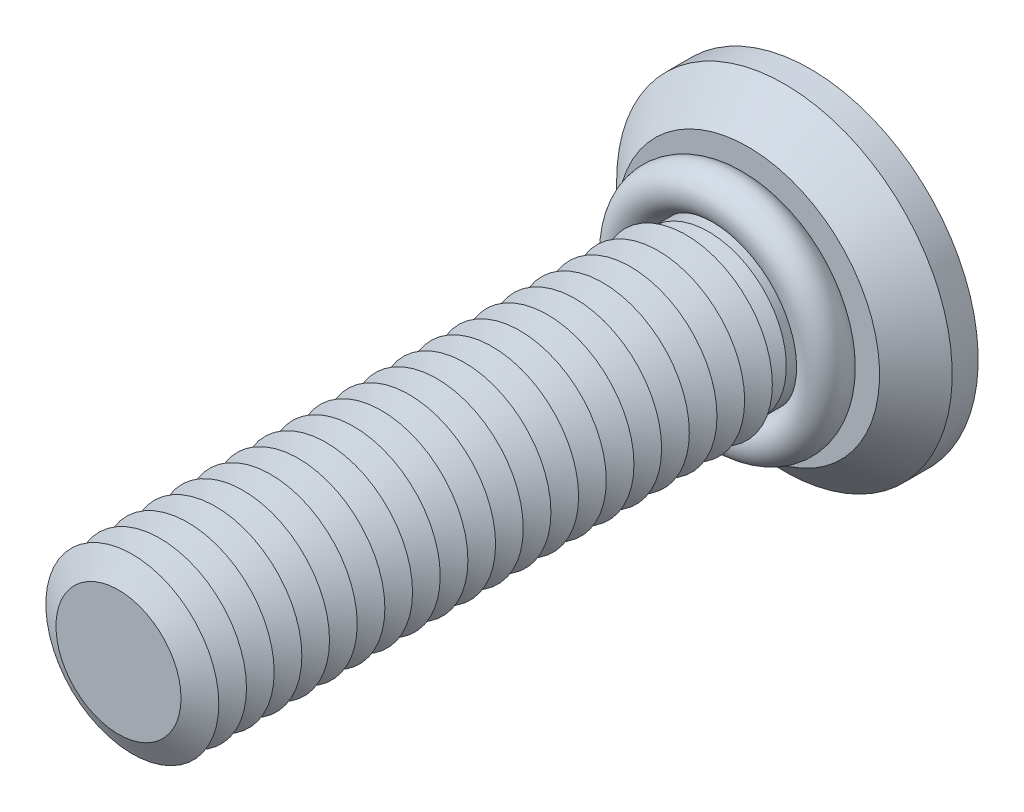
ISO-10303-21;
HEADER;
FILE_DESCRIPTION(('STEP AP214'),'2;1');
FILE_NAME('part.step','',(''),(''),'','','');
FILE_SCHEMA(('AUTOMOTIVE_DESIGN { 1 0 10303 214 1 1 1 1 }'));
ENDSEC;
DATA;
#1=APPLICATION_CONTEXT('core data for automotive mechanical design processes');
#2=APPLICATION_PROTOCOL_DEFINITION('international standard','automotive_design',2000,#1);
#3=PRODUCT_CONTEXT('',#1,'mechanical');
#4=PRODUCT('Part','Part','',(#3));
#5=PRODUCT_RELATED_PRODUCT_CATEGORY('part','',(#4));
#6=PRODUCT_DEFINITION_FORMATION('','',#4);
#7=PRODUCT_DEFINITION_CONTEXT('part definition',#1,'design');
#8=PRODUCT_DEFINITION('design','',#6,#7);
#9=PRODUCT_DEFINITION_SHAPE('','',#8);
#10=(LENGTH_UNIT() NAMED_UNIT(*) SI_UNIT(.MILLI.,.METRE.));
#11=(NAMED_UNIT(*) PLANE_ANGLE_UNIT() SI_UNIT($,.RADIAN.));
#12=(NAMED_UNIT(*) SI_UNIT($,.STERADIAN.) SOLID_ANGLE_UNIT());
#13=UNCERTAINTY_MEASURE_WITH_UNIT(LENGTH_MEASURE(1.E-05),#10,'distance_accuracy_value','');
#14=(GEOMETRIC_REPRESENTATION_CONTEXT(3) GLOBAL_UNCERTAINTY_ASSIGNED_CONTEXT((#13)) GLOBAL_UNIT_ASSIGNED_CONTEXT((#10,
#11,#12)) REPRESENTATION_CONTEXT('',''));
#15=CARTESIAN_POINT('',(0.,0.,0.));
#16=DIRECTION('',(0.,0.,1.));
#17=DIRECTION('',(1.,0.,0.));
#18=AXIS2_PLACEMENT_3D('',#15,#16,#17);
#19=CARTESIAN_POINT('',(0.,0.,2.4));
#20=DIRECTION('',(0.,0.,1.));
#21=DIRECTION('',(1.,0.,0.));
#22=AXIS2_PLACEMENT_3D('',#19,#20,#21);
#23=TOROIDAL_SURFACE('',#22,2.85,0.6);
#24=CARTESIAN_POINT('',(0.,2.85,2.4));
#25=DIRECTION('',(1.,0.,0.));
#26=DIRECTION('',(0.,0.,-1.));
#27=AXIS2_PLACEMENT_3D('',#24,#25,#26);
#28=CIRCLE('',#27,0.6);
#29=CARTESIAN_POINT('',(0.,3.45,2.4));
#30=VERTEX_POINT('',#29);
#31=EDGE_CURVE('P0_E10',#30,#30,#28,.T.);
#32=CARTESIAN_POINT('',(0.,0.,2.4));
#33=DIRECTION('',(0.,0.,1.));
#34=DIRECTION('',(1.,0.,0.));
#35=AXIS2_PLACEMENT_3D('',#32,#33,#34);
#36=CIRCLE('',#35,3.45);
#37=EDGE_CURVE('',#30,#30,#36,.T.);
#38=ORIENTED_EDGE('',*,*,#31,.F.);
#39=ORIENTED_EDGE('',*,*,#31,.T.);
#40=ORIENTED_EDGE('',*,*,#37,.T.);
#41=ORIENTED_EDGE('',*,*,#37,.F.);
#42=EDGE_LOOP('',(#38,#40,#39,#41));
#43=FACE_BOUND('',#42,.T.);
#44=ADVANCED_FACE('P0_F14',(#43),#23,.T.);
#45=CLOSED_SHELL('',(#44));
#46=MANIFOLD_SOLID_BREP('P0_B1',#45);
#47=CARTESIAN_POINT('',(0.,0.,16.));
#48=DIRECTION('',(0.,0.,-1.));
#49=DIRECTION('',(-1.,0.,0.));
#50=AXIS2_PLACEMENT_3D('',#47,#48,#49);
#51=CONICAL_SURFACE('',#50,1.80717967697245,1.0471975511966);
#52=CARTESIAN_POINT('',(0.,0.,15.6));
#53=DIRECTION('',(0.,0.,1.));
#54=DIRECTION('',(1.,0.,0.));
#55=AXIS2_PLACEMENT_3D('',#52,#53,#54);
#56=CIRCLE('',#55,2.5);
#57=CARTESIAN_POINT('',(2.5,0.,15.6));
#58=VERTEX_POINT('',#57);
#59=EDGE_CURVE('P1_E324',#58,#58,#56,.T.);
#60=ORIENTED_EDGE('',*,*,#59,.T.);
#61=EDGE_LOOP('',(#60));
#62=FACE_BOUND('',#61,.T.);
#63=CARTESIAN_POINT('',(0.,0.,16.));
#64=DIRECTION('',(0.,0.,1.));
#65=DIRECTION('',(1.,0.,0.));
#66=AXIS2_PLACEMENT_3D('',#63,#64,#65);
#67=CIRCLE('',#66,1.80717967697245);
#68=CARTESIAN_POINT('',(1.80717967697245,0.,16.));
#69=VERTEX_POINT('',#68);
#70=EDGE_CURVE('P1_E321',#69,#69,#67,.T.);
#71=ORIENTED_EDGE('',*,*,#70,.F.);
#72=EDGE_LOOP('',(#71));
#73=FACE_BOUND('',#72,.T.);
#74=ADVANCED_FACE('P1_F15',(#62,#73),#51,.T.);
#75=CARTESIAN_POINT('',(0.,0.,16.4));
#76=DIRECTION('',(0.,0.,1.));
#77=DIRECTION('',(1.,0.,0.));
#78=AXIS2_PLACEMENT_3D('',#75,#76,#77);
#79=CONICAL_SURFACE('',#78,2.5,1.0471975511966);
#80=ORIENTED_EDGE('',*,*,#70,.T.);
#81=EDGE_LOOP('',(#80));
#82=FACE_BOUND('',#81,.T.);
#83=CARTESIAN_POINT('',(0.,0.,16.4));
#84=DIRECTION('',(0.,0.,1.));
#85=DIRECTION('',(1.,0.,0.));
#86=AXIS2_PLACEMENT_3D('',#83,#84,#85);
#87=CIRCLE('',#86,2.5);
#88=CARTESIAN_POINT('',(2.5,0.,16.4));
#89=VERTEX_POINT('',#88);
#90=EDGE_CURVE('P1_E318',#89,#89,#87,.T.);
#91=ORIENTED_EDGE('',*,*,#90,.F.);
#92=EDGE_LOOP('',(#91));
#93=FACE_BOUND('',#92,.T.);
#94=ADVANCED_FACE('P1_F245',(#82,#93),#79,.T.);
#95=CARTESIAN_POINT('',(0.,0.,20.));
#96=DIRECTION('',(0.,0.,1.));
#97=DIRECTION('',(1.,0.,0.));
#98=AXIS2_PLACEMENT_3D('',#95,#96,#97);
#99=PLANE('',#98);
#100=CARTESIAN_POINT('',(0.,0.,20.));
#101=DIRECTION('',(0.,0.,1.));
#102=DIRECTION('',(1.,0.,0.));
#103=AXIS2_PLACEMENT_3D('',#100,#101,#102);
#104=CIRCLE('',#103,1.80717967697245);
#105=CARTESIAN_POINT('',(1.80717967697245,0.,20.));
#106=VERTEX_POINT('',#105);
#107=EDGE_CURVE('P1_E131',#106,#106,#104,.T.);
#108=ORIENTED_EDGE('',*,*,#107,.T.);
#109=EDGE_LOOP('',(#108));
#110=FACE_BOUND('',#109,.T.);
#111=ADVANCED_FACE('P1_F251',(#110),#99,.T.);
#112=CARTESIAN_POINT('',(0.,0.,20.));
#113=DIRECTION('',(0.,0.,-1.));
#114=DIRECTION('',(-1.,0.,0.));
#115=AXIS2_PLACEMENT_3D('',#112,#113,#114);
#116=CONICAL_SURFACE('',#115,1.80717967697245,1.0471975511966);
#117=CARTESIAN_POINT('',(0.,0.,19.6));
#118=DIRECTION('',(0.,0.,1.));
#119=DIRECTION('',(1.,0.,0.));
#120=AXIS2_PLACEMENT_3D('',#117,#118,#119);
#121=CIRCLE('',#120,2.5);
#122=CARTESIAN_POINT('',(2.5,0.,19.6));
#123=VERTEX_POINT('',#122);
#124=EDGE_CURVE('P1_E133',#123,#123,#121,.T.);
#125=ORIENTED_EDGE('',*,*,#124,.T.);
#126=EDGE_LOOP('',(#125));
#127=FACE_BOUND('',#126,.T.);
#128=ORIENTED_EDGE('',*,*,#107,.F.);
#129=EDGE_LOOP('',(#128));
#130=FACE_BOUND('',#129,.T.);
#131=ADVANCED_FACE('P1_F196',(#127,#130),#116,.T.);
#132=CARTESIAN_POINT('',(0.,0.,19.6));
#133=DIRECTION('',(0.,0.,1.));
#134=DIRECTION('',(1.,0.,0.));
#135=AXIS2_PLACEMENT_3D('',#132,#133,#134);
#136=CONICAL_SURFACE('',#135,2.5,1.0471975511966);
#137=CARTESIAN_POINT('',(0.,0.,19.2));
#138=DIRECTION('',(0.,0.,1.));
#139=DIRECTION('',(1.,0.,0.));
#140=AXIS2_PLACEMENT_3D('',#137,#138,#139);
#141=CIRCLE('',#140,1.80717967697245);
#142=CARTESIAN_POINT('',(1.80717967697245,0.,19.2));
#143=VERTEX_POINT('',#142);
#144=EDGE_CURVE('P1_E297',#143,#143,#141,.T.);
#145=ORIENTED_EDGE('',*,*,#144,.T.);
#146=EDGE_LOOP('',(#145));
#147=FACE_BOUND('',#146,.T.);
#148=ORIENTED_EDGE('',*,*,#124,.F.);
#149=EDGE_LOOP('',(#148));
#150=FACE_BOUND('',#149,.T.);
#151=ADVANCED_FACE('P1_F284',(#147,#150),#136,.T.);
#152=CARTESIAN_POINT('',(0.,0.,19.2));
#153=DIRECTION('',(0.,0.,-1.));
#154=DIRECTION('',(-1.,0.,0.));
#155=AXIS2_PLACEMENT_3D('',#152,#153,#154);
#156=CONICAL_SURFACE('',#155,1.80717967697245,1.0471975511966);
#157=CARTESIAN_POINT('',(0.,0.,18.8));
#158=DIRECTION('',(0.,0.,1.));
#159=DIRECTION('',(1.,0.,0.));
#160=AXIS2_PLACEMENT_3D('',#157,#158,#159);
#161=CIRCLE('',#160,2.5);
#162=CARTESIAN_POINT('',(2.5,0.,18.8));
#163=VERTEX_POINT('',#162);
#164=EDGE_CURVE('P1_E294',#163,#163,#161,.T.);
#165=ORIENTED_EDGE('',*,*,#164,.T.);
#166=EDGE_LOOP('',(#165));
#167=FACE_BOUND('',#166,.T.);
#168=ORIENTED_EDGE('',*,*,#144,.F.);
#169=EDGE_LOOP('',(#168));
#170=FACE_BOUND('',#169,.T.);
#171=ADVANCED_FACE('P1_F279',(#167,#170),#156,.T.);
#172=CARTESIAN_POINT('',(0.,0.,18.8));
#173=DIRECTION('',(0.,0.,1.));
#174=DIRECTION('',(1.,0.,0.));
#175=AXIS2_PLACEMENT_3D('',#172,#173,#174);
#176=CONICAL_SURFACE('',#175,2.5,1.0471975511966);
#177=CARTESIAN_POINT('',(0.,0.,18.4));
#178=DIRECTION('',(0.,0.,1.));
#179=DIRECTION('',(1.,0.,0.));
#180=AXIS2_PLACEMENT_3D('',#177,#178,#179);
#181=CIRCLE('',#180,1.80717967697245);
#182=CARTESIAN_POINT('',(1.80717967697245,0.,18.4));
#183=VERTEX_POINT('',#182);
#184=EDGE_CURVE('P1_E301',#183,#183,#181,.T.);
#185=ORIENTED_EDGE('',*,*,#184,.T.);
#186=EDGE_LOOP('',(#185));
#187=FACE_BOUND('',#186,.T.);
#188=ORIENTED_EDGE('',*,*,#164,.F.);
#189=EDGE_LOOP('',(#188));
#190=FACE_BOUND('',#189,.T.);
#191=ADVANCED_FACE('P1_F276',(#187,#190),#176,.T.);
#192=CARTESIAN_POINT('',(0.,0.,18.4));
#193=DIRECTION('',(0.,0.,-1.));
#194=DIRECTION('',(-1.,0.,0.));
#195=AXIS2_PLACEMENT_3D('',#192,#193,#194);
#196=CONICAL_SURFACE('',#195,1.80717967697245,1.0471975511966);
#197=CARTESIAN_POINT('',(0.,0.,18.));
#198=DIRECTION('',(0.,0.,1.));
#199=DIRECTION('',(1.,0.,0.));
#200=AXIS2_PLACEMENT_3D('',#197,#198,#199);
#201=CIRCLE('',#200,2.5);
#202=CARTESIAN_POINT('',(2.5,0.,18.));
#203=VERTEX_POINT('',#202);
#204=EDGE_CURVE('P1_E306',#203,#203,#201,.T.);
#205=ORIENTED_EDGE('',*,*,#204,.T.);
#206=EDGE_LOOP('',(#205));
#207=FACE_BOUND('',#206,.T.);
#208=ORIENTED_EDGE('',*,*,#184,.F.);
#209=EDGE_LOOP('',(#208));
#210=FACE_BOUND('',#209,.T.);
#211=ADVANCED_FACE('P1_F271',(#207,#210),#196,.T.);
#212=CARTESIAN_POINT('',(0.,0.,18.));
#213=DIRECTION('',(0.,0.,1.));
#214=DIRECTION('',(1.,0.,0.));
#215=AXIS2_PLACEMENT_3D('',#212,#213,#214);
#216=CONICAL_SURFACE('',#215,2.5,1.0471975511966);
#217=CARTESIAN_POINT('',(0.,0.,17.6));
#218=DIRECTION('',(0.,0.,1.));
#219=DIRECTION('',(1.,0.,0.));
#220=AXIS2_PLACEMENT_3D('',#217,#218,#219);
#221=CIRCLE('',#220,1.80717967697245);
#222=CARTESIAN_POINT('',(1.80717967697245,0.,17.6));
#223=VERTEX_POINT('',#222);
#224=EDGE_CURVE('P1_E309',#223,#223,#221,.T.);
#225=ORIENTED_EDGE('',*,*,#224,.T.);
#226=EDGE_LOOP('',(#225));
#227=FACE_BOUND('',#226,.T.);
#228=ORIENTED_EDGE('',*,*,#204,.F.);
#229=EDGE_LOOP('',(#228));
#230=FACE_BOUND('',#229,.T.);
#231=ADVANCED_FACE('P1_F268',(#227,#230),#216,.T.);
#232=CARTESIAN_POINT('',(0.,0.,17.6));
#233=DIRECTION('',(0.,0.,-1.));
#234=DIRECTION('',(-1.,0.,0.));
#235=AXIS2_PLACEMENT_3D('',#232,#233,#234);
#236=CONICAL_SURFACE('',#235,1.80717967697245,1.0471975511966);
#237=CARTESIAN_POINT('',(0.,0.,17.2));
#238=DIRECTION('',(0.,0.,1.));
#239=DIRECTION('',(1.,0.,0.));
#240=AXIS2_PLACEMENT_3D('',#237,#238,#239);
#241=CIRCLE('',#240,2.5);
#242=CARTESIAN_POINT('',(2.5,0.,17.2));
#243=VERTEX_POINT('',#242);
#244=EDGE_CURVE('P1_E312',#243,#243,#241,.T.);
#245=ORIENTED_EDGE('',*,*,#244,.T.);
#246=EDGE_LOOP('',(#245));
#247=FACE_BOUND('',#246,.T.);
#248=ORIENTED_EDGE('',*,*,#224,.F.);
#249=EDGE_LOOP('',(#248));
#250=FACE_BOUND('',#249,.T.);
#251=ADVANCED_FACE('P1_F262',(#247,#250),#236,.T.);
#252=CARTESIAN_POINT('',(0.,0.,17.2));
#253=DIRECTION('',(0.,0.,1.));
#254=DIRECTION('',(1.,0.,0.));
#255=AXIS2_PLACEMENT_3D('',#252,#253,#254);
#256=CONICAL_SURFACE('',#255,2.5,1.0471975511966);
#257=CARTESIAN_POINT('',(0.,0.,16.8));
#258=DIRECTION('',(0.,0.,1.));
#259=DIRECTION('',(1.,0.,0.));
#260=AXIS2_PLACEMENT_3D('',#257,#258,#259);
#261=CIRCLE('',#260,1.80717967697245);
#262=CARTESIAN_POINT('',(1.80717967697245,0.,16.8));
#263=VERTEX_POINT('',#262);
#264=EDGE_CURVE('P1_E315',#263,#263,#261,.T.);
#265=ORIENTED_EDGE('',*,*,#264,.T.);
#266=EDGE_LOOP('',(#265));
#267=FACE_BOUND('',#266,.T.);
#268=ORIENTED_EDGE('',*,*,#244,.F.);
#269=EDGE_LOOP('',(#268));
#270=FACE_BOUND('',#269,.T.);
#271=ADVANCED_FACE('P1_F258',(#267,#270),#256,.T.);
#272=CARTESIAN_POINT('',(0.,0.,16.8));
#273=DIRECTION('',(0.,0.,-1.));
#274=DIRECTION('',(-1.,0.,0.));
#275=AXIS2_PLACEMENT_3D('',#272,#273,#274);
#276=CONICAL_SURFACE('',#275,1.80717967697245,1.0471975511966);
#277=ORIENTED_EDGE('',*,*,#90,.T.);
#278=EDGE_LOOP('',(#277));
#279=FACE_BOUND('',#278,.T.);
#280=ORIENTED_EDGE('',*,*,#264,.F.);
#281=EDGE_LOOP('',(#280));
#282=FACE_BOUND('',#281,.T.);
#283=ADVANCED_FACE('P1_F261',(#279,#282),#276,.T.);
#284=CARTESIAN_POINT('',(0.,0.,15.2));
#285=DIRECTION('',(0.,0.,-1.));
#286=DIRECTION('',(-1.,0.,0.));
#287=AXIS2_PLACEMENT_3D('',#284,#285,#286);
#288=CONICAL_SURFACE('',#287,1.80717967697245,1.0471975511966);
#289=CARTESIAN_POINT('',(0.,0.,14.8));
#290=DIRECTION('',(0.,0.,1.));
#291=DIRECTION('',(1.,0.,0.));
#292=AXIS2_PLACEMENT_3D('',#289,#290,#291);
#293=CIRCLE('',#292,2.5);
#294=CARTESIAN_POINT('',(2.5,0.,14.8));
#295=VERTEX_POINT('',#294);
#296=EDGE_CURVE('P1_E329',#295,#295,#293,.T.);
#297=ORIENTED_EDGE('',*,*,#296,.T.);
#298=EDGE_LOOP('',(#297));
#299=FACE_BOUND('',#298,.T.);
#300=CARTESIAN_POINT('',(0.,0.,15.2));
#301=DIRECTION('',(0.,0.,1.));
#302=DIRECTION('',(1.,0.,0.));
#303=AXIS2_PLACEMENT_3D('',#300,#301,#302);
#304=CIRCLE('',#303,1.80717967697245);
#305=CARTESIAN_POINT('',(1.80717967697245,0.,15.2));
#306=VERTEX_POINT('',#305);
#307=EDGE_CURVE('P1_E326',#306,#306,#304,.T.);
#308=ORIENTED_EDGE('',*,*,#307,.F.);
#309=EDGE_LOOP('',(#308));
#310=FACE_BOUND('',#309,.T.);
#311=ADVANCED_FACE('P1_F266',(#299,#310),#288,.T.);
#312=CARTESIAN_POINT('',(0.,0.,15.6));
#313=DIRECTION('',(0.,0.,1.));
#314=DIRECTION('',(1.,0.,0.));
#315=AXIS2_PLACEMENT_3D('',#312,#313,#314);
#316=CONICAL_SURFACE('',#315,2.5,1.0471975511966);
#317=ORIENTED_EDGE('',*,*,#307,.T.);
#318=EDGE_LOOP('',(#317));
#319=FACE_BOUND('',#318,.T.);
#320=ORIENTED_EDGE('',*,*,#59,.F.);
#321=EDGE_LOOP('',(#320));
#322=FACE_BOUND('',#321,.T.);
#323=ADVANCED_FACE('P1_F521',(#319,#322),#316,.T.);
#324=CARTESIAN_POINT('',(0.,0.,14.4));
#325=DIRECTION('',(0.,0.,-1.));
#326=DIRECTION('',(-1.,0.,0.));
#327=AXIS2_PLACEMENT_3D('',#324,#325,#326);
#328=CONICAL_SURFACE('',#327,1.80717967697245,1.0471975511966);
#329=CARTESIAN_POINT('',(0.,0.,14.));
#330=DIRECTION('',(0.,0.,1.));
#331=DIRECTION('',(1.,0.,0.));
#332=AXIS2_PLACEMENT_3D('',#329,#330,#331);
#333=CIRCLE('',#332,2.5);
#334=CARTESIAN_POINT('',(2.5,0.,14.));
#335=VERTEX_POINT('',#334);
#336=EDGE_CURVE('P1_E335',#335,#335,#333,.T.);
#337=ORIENTED_EDGE('',*,*,#336,.T.);
#338=EDGE_LOOP('',(#337));
#339=FACE_BOUND('',#338,.T.);
#340=CARTESIAN_POINT('',(0.,0.,14.4));
#341=DIRECTION('',(0.,0.,1.));
#342=DIRECTION('',(1.,0.,0.));
#343=AXIS2_PLACEMENT_3D('',#340,#341,#342);
#344=CIRCLE('',#343,1.80717967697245);
#345=CARTESIAN_POINT('',(1.80717967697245,0.,14.4));
#346=VERTEX_POINT('',#345);
#347=EDGE_CURVE('P1_E332',#346,#346,#344,.T.);
#348=ORIENTED_EDGE('',*,*,#347,.F.);
#349=EDGE_LOOP('',(#348));
#350=FACE_BOUND('',#349,.T.);
#351=ADVANCED_FACE('P1_F530',(#339,#350),#328,.T.);
#352=CARTESIAN_POINT('',(0.,0.,14.8));
#353=DIRECTION('',(0.,0.,1.));
#354=DIRECTION('',(1.,0.,0.));
#355=AXIS2_PLACEMENT_3D('',#352,#353,#354);
#356=CONICAL_SURFACE('',#355,2.5,1.0471975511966);
#357=ORIENTED_EDGE('',*,*,#347,.T.);
#358=EDGE_LOOP('',(#357));
#359=FACE_BOUND('',#358,.T.);
#360=ORIENTED_EDGE('',*,*,#296,.F.);
#361=EDGE_LOOP('',(#360));
#362=FACE_BOUND('',#361,.T.);
#363=ADVANCED_FACE('P1_F540',(#359,#362),#356,.T.);
#364=CARTESIAN_POINT('',(0.,0.,13.6));
#365=DIRECTION('',(0.,0.,-1.));
#366=DIRECTION('',(-1.,0.,0.));
#367=AXIS2_PLACEMENT_3D('',#364,#365,#366);
#368=CONICAL_SURFACE('',#367,1.80717967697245,1.0471975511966);
#369=CARTESIAN_POINT('',(0.,0.,13.2));
#370=DIRECTION('',(0.,0.,1.));
#371=DIRECTION('',(1.,0.,0.));
#372=AXIS2_PLACEMENT_3D('',#369,#370,#371);
#373=CIRCLE('',#372,2.5);
#374=CARTESIAN_POINT('',(2.5,0.,13.2));
#375=VERTEX_POINT('',#374);
#376=EDGE_CURVE('P1_E341',#375,#375,#373,.T.);
#377=ORIENTED_EDGE('',*,*,#376,.T.);
#378=EDGE_LOOP('',(#377));
#379=FACE_BOUND('',#378,.T.);
#380=CARTESIAN_POINT('',(0.,0.,13.6));
#381=DIRECTION('',(0.,0.,1.));
#382=DIRECTION('',(1.,0.,0.));
#383=AXIS2_PLACEMENT_3D('',#380,#381,#382);
#384=CIRCLE('',#383,1.80717967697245);
#385=CARTESIAN_POINT('',(1.80717967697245,0.,13.6));
#386=VERTEX_POINT('',#385);
#387=EDGE_CURVE('P1_E338',#386,#386,#384,.T.);
#388=ORIENTED_EDGE('',*,*,#387,.F.);
#389=EDGE_LOOP('',(#388));
#390=FACE_BOUND('',#389,.T.);
#391=ADVANCED_FACE('P1_F550',(#379,#390),#368,.T.);
#392=CARTESIAN_POINT('',(0.,0.,14.));
#393=DIRECTION('',(0.,0.,1.));
#394=DIRECTION('',(1.,0.,0.));
#395=AXIS2_PLACEMENT_3D('',#392,#393,#394);
#396=CONICAL_SURFACE('',#395,2.5,1.0471975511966);
#397=ORIENTED_EDGE('',*,*,#387,.T.);
#398=EDGE_LOOP('',(#397));
#399=FACE_BOUND('',#398,.T.);
#400=ORIENTED_EDGE('',*,*,#336,.F.);
#401=EDGE_LOOP('',(#400));
#402=FACE_BOUND('',#401,.T.);
#403=ADVANCED_FACE('P1_F560',(#399,#402),#396,.T.);
#404=CARTESIAN_POINT('',(0.,0.,12.8));
#405=DIRECTION('',(0.,0.,-1.));
#406=DIRECTION('',(-1.,0.,0.));
#407=AXIS2_PLACEMENT_3D('',#404,#405,#406);
#408=CONICAL_SURFACE('',#407,1.80717967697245,1.0471975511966);
#409=CARTESIAN_POINT('',(0.,0.,12.4));
#410=DIRECTION('',(0.,0.,1.));
#411=DIRECTION('',(1.,0.,0.));
#412=AXIS2_PLACEMENT_3D('',#409,#410,#411);
#413=CIRCLE('',#412,2.5);
#414=CARTESIAN_POINT('',(2.5,0.,12.4));
#415=VERTEX_POINT('',#414);
#416=EDGE_CURVE('P1_E347',#415,#415,#413,.T.);
#417=ORIENTED_EDGE('',*,*,#416,.T.);
#418=EDGE_LOOP('',(#417));
#419=FACE_BOUND('',#418,.T.);
#420=CARTESIAN_POINT('',(0.,0.,12.8));
#421=DIRECTION('',(0.,0.,1.));
#422=DIRECTION('',(1.,0.,0.));
#423=AXIS2_PLACEMENT_3D('',#420,#421,#422);
#424=CIRCLE('',#423,1.80717967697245);
#425=CARTESIAN_POINT('',(1.80717967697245,0.,12.8));
#426=VERTEX_POINT('',#425);
#427=EDGE_CURVE('P1_E344',#426,#426,#424,.T.);
#428=ORIENTED_EDGE('',*,*,#427,.F.);
#429=EDGE_LOOP('',(#428));
#430=FACE_BOUND('',#429,.T.);
#431=ADVANCED_FACE('P1_F570',(#419,#430),#408,.T.);
#432=CARTESIAN_POINT('',(0.,0.,13.2));
#433=DIRECTION('',(0.,0.,1.));
#434=DIRECTION('',(1.,0.,0.));
#435=AXIS2_PLACEMENT_3D('',#432,#433,#434);
#436=CONICAL_SURFACE('',#435,2.5,1.0471975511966);
#437=ORIENTED_EDGE('',*,*,#427,.T.);
#438=EDGE_LOOP('',(#437));
#439=FACE_BOUND('',#438,.T.);
#440=ORIENTED_EDGE('',*,*,#376,.F.);
#441=EDGE_LOOP('',(#440));
#442=FACE_BOUND('',#441,.T.);
#443=ADVANCED_FACE('P1_F580',(#439,#442),#436,.T.);
#444=CARTESIAN_POINT('',(0.,0.,12.));
#445=DIRECTION('',(0.,0.,-1.));
#446=DIRECTION('',(-1.,0.,0.));
#447=AXIS2_PLACEMENT_3D('',#444,#445,#446);
#448=CONICAL_SURFACE('',#447,1.80717967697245,1.0471975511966);
#449=CARTESIAN_POINT('',(0.,0.,11.6));
#450=DIRECTION('',(0.,0.,1.));
#451=DIRECTION('',(1.,0.,0.));
#452=AXIS2_PLACEMENT_3D('',#449,#450,#451);
#453=CIRCLE('',#452,2.5);
#454=CARTESIAN_POINT('',(2.5,0.,11.6));
#455=VERTEX_POINT('',#454);
#456=EDGE_CURVE('P1_E353',#455,#455,#453,.T.);
#457=ORIENTED_EDGE('',*,*,#456,.T.);
#458=EDGE_LOOP('',(#457));
#459=FACE_BOUND('',#458,.T.);
#460=CARTESIAN_POINT('',(0.,0.,12.));
#461=DIRECTION('',(0.,0.,1.));
#462=DIRECTION('',(1.,0.,0.));
#463=AXIS2_PLACEMENT_3D('',#460,#461,#462);
#464=CIRCLE('',#463,1.80717967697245);
#465=CARTESIAN_POINT('',(1.80717967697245,0.,12.));
#466=VERTEX_POINT('',#465);
#467=EDGE_CURVE('P1_E350',#466,#466,#464,.T.);
#468=ORIENTED_EDGE('',*,*,#467,.F.);
#469=EDGE_LOOP('',(#468));
#470=FACE_BOUND('',#469,.T.);
#471=ADVANCED_FACE('P1_F590',(#459,#470),#448,.T.);
#472=CARTESIAN_POINT('',(0.,0.,12.4));
#473=DIRECTION('',(0.,0.,1.));
#474=DIRECTION('',(1.,0.,0.));
#475=AXIS2_PLACEMENT_3D('',#472,#473,#474);
#476=CONICAL_SURFACE('',#475,2.5,1.0471975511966);
#477=ORIENTED_EDGE('',*,*,#467,.T.);
#478=EDGE_LOOP('',(#477));
#479=FACE_BOUND('',#478,.T.);
#480=ORIENTED_EDGE('',*,*,#416,.F.);
#481=EDGE_LOOP('',(#480));
#482=FACE_BOUND('',#481,.T.);
#483=ADVANCED_FACE('P1_F600',(#479,#482),#476,.T.);
#484=CARTESIAN_POINT('',(0.,0.,11.2));
#485=DIRECTION('',(0.,0.,-1.));
#486=DIRECTION('',(-1.,0.,0.));
#487=AXIS2_PLACEMENT_3D('',#484,#485,#486);
#488=CONICAL_SURFACE('',#487,1.80717967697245,1.0471975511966);
#489=CARTESIAN_POINT('',(0.,0.,10.8));
#490=DIRECTION('',(0.,0.,1.));
#491=DIRECTION('',(1.,0.,0.));
#492=AXIS2_PLACEMENT_3D('',#489,#490,#491);
#493=CIRCLE('',#492,2.5);
#494=CARTESIAN_POINT('',(2.5,0.,10.8));
#495=VERTEX_POINT('',#494);
#496=EDGE_CURVE('P1_E359',#495,#495,#493,.T.);
#497=ORIENTED_EDGE('',*,*,#496,.T.);
#498=EDGE_LOOP('',(#497));
#499=FACE_BOUND('',#498,.T.);
#500=CARTESIAN_POINT('',(0.,0.,11.2));
#501=DIRECTION('',(0.,0.,1.));
#502=DIRECTION('',(1.,0.,0.));
#503=AXIS2_PLACEMENT_3D('',#500,#501,#502);
#504=CIRCLE('',#503,1.80717967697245);
#505=CARTESIAN_POINT('',(1.80717967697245,0.,11.2));
#506=VERTEX_POINT('',#505);
#507=EDGE_CURVE('P1_E356',#506,#506,#504,.T.);
#508=ORIENTED_EDGE('',*,*,#507,.F.);
#509=EDGE_LOOP('',(#508));
#510=FACE_BOUND('',#509,.T.);
#511=ADVANCED_FACE('P1_F610',(#499,#510),#488,.T.);
#512=CARTESIAN_POINT('',(0.,0.,11.6));
#513=DIRECTION('',(0.,0.,1.));
#514=DIRECTION('',(1.,0.,0.));
#515=AXIS2_PLACEMENT_3D('',#512,#513,#514);
#516=CONICAL_SURFACE('',#515,2.5,1.0471975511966);
#517=ORIENTED_EDGE('',*,*,#507,.T.);
#518=EDGE_LOOP('',(#517));
#519=FACE_BOUND('',#518,.T.);
#520=ORIENTED_EDGE('',*,*,#456,.F.);
#521=EDGE_LOOP('',(#520));
#522=FACE_BOUND('',#521,.T.);
#523=ADVANCED_FACE('P1_F620',(#519,#522),#516,.T.);
#524=CARTESIAN_POINT('',(0.,0.,10.4));
#525=DIRECTION('',(0.,0.,-1.));
#526=DIRECTION('',(-1.,0.,0.));
#527=AXIS2_PLACEMENT_3D('',#524,#525,#526);
#528=CONICAL_SURFACE('',#527,1.80717967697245,1.0471975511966);
#529=CARTESIAN_POINT('',(0.,0.,10.));
#530=DIRECTION('',(0.,0.,1.));
#531=DIRECTION('',(1.,0.,0.));
#532=AXIS2_PLACEMENT_3D('',#529,#530,#531);
#533=CIRCLE('',#532,2.5);
#534=CARTESIAN_POINT('',(2.5,0.,10.));
#535=VERTEX_POINT('',#534);
#536=EDGE_CURVE('P1_E365',#535,#535,#533,.T.);
#537=ORIENTED_EDGE('',*,*,#536,.T.);
#538=EDGE_LOOP('',(#537));
#539=FACE_BOUND('',#538,.T.);
#540=CARTESIAN_POINT('',(0.,0.,10.4));
#541=DIRECTION('',(0.,0.,1.));
#542=DIRECTION('',(1.,0.,0.));
#543=AXIS2_PLACEMENT_3D('',#540,#541,#542);
#544=CIRCLE('',#543,1.80717967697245);
#545=CARTESIAN_POINT('',(1.80717967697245,0.,10.4));
#546=VERTEX_POINT('',#545);
#547=EDGE_CURVE('P1_E362',#546,#546,#544,.T.);
#548=ORIENTED_EDGE('',*,*,#547,.F.);
#549=EDGE_LOOP('',(#548));
#550=FACE_BOUND('',#549,.T.);
#551=ADVANCED_FACE('P1_F630',(#539,#550),#528,.T.);
#552=CARTESIAN_POINT('',(0.,0.,10.8));
#553=DIRECTION('',(0.,0.,1.));
#554=DIRECTION('',(1.,0.,0.));
#555=AXIS2_PLACEMENT_3D('',#552,#553,#554);
#556=CONICAL_SURFACE('',#555,2.5,1.0471975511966);
#557=ORIENTED_EDGE('',*,*,#547,.T.);
#558=EDGE_LOOP('',(#557));
#559=FACE_BOUND('',#558,.T.);
#560=ORIENTED_EDGE('',*,*,#496,.F.);
#561=EDGE_LOOP('',(#560));
#562=FACE_BOUND('',#561,.T.);
#563=ADVANCED_FACE('P1_F640',(#559,#562),#556,.T.);
#564=CARTESIAN_POINT('',(0.,0.,9.6));
#565=DIRECTION('',(0.,0.,-1.));
#566=DIRECTION('',(-1.,0.,0.));
#567=AXIS2_PLACEMENT_3D('',#564,#565,#566);
#568=CONICAL_SURFACE('',#567,1.80717967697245,1.0471975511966);
#569=CARTESIAN_POINT('',(0.,0.,9.2));
#570=DIRECTION('',(0.,0.,1.));
#571=DIRECTION('',(1.,0.,0.));
#572=AXIS2_PLACEMENT_3D('',#569,#570,#571);
#573=CIRCLE('',#572,2.5);
#574=CARTESIAN_POINT('',(2.5,0.,9.2));
#575=VERTEX_POINT('',#574);
#576=EDGE_CURVE('P1_E371',#575,#575,#573,.T.);
#577=ORIENTED_EDGE('',*,*,#576,.T.);
#578=EDGE_LOOP('',(#577));
#579=FACE_BOUND('',#578,.T.);
#580=CARTESIAN_POINT('',(0.,0.,9.6));
#581=DIRECTION('',(0.,0.,1.));
#582=DIRECTION('',(1.,0.,0.));
#583=AXIS2_PLACEMENT_3D('',#580,#581,#582);
#584=CIRCLE('',#583,1.80717967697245);
#585=CARTESIAN_POINT('',(1.80717967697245,0.,9.6));
#586=VERTEX_POINT('',#585);
#587=EDGE_CURVE('P1_E368',#586,#586,#584,.T.);
#588=ORIENTED_EDGE('',*,*,#587,.F.);
#589=EDGE_LOOP('',(#588));
#590=FACE_BOUND('',#589,.T.);
#591=ADVANCED_FACE('P1_F650',(#579,#590),#568,.T.);
#592=CARTESIAN_POINT('',(0.,0.,10.));
#593=DIRECTION('',(0.,0.,1.));
#594=DIRECTION('',(1.,0.,0.));
#595=AXIS2_PLACEMENT_3D('',#592,#593,#594);
#596=CONICAL_SURFACE('',#595,2.5,1.0471975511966);
#597=ORIENTED_EDGE('',*,*,#587,.T.);
#598=EDGE_LOOP('',(#597));
#599=FACE_BOUND('',#598,.T.);
#600=ORIENTED_EDGE('',*,*,#536,.F.);
#601=EDGE_LOOP('',(#600));
#602=FACE_BOUND('',#601,.T.);
#603=ADVANCED_FACE('P1_F660',(#599,#602),#596,.T.);
#604=CARTESIAN_POINT('',(0.,0.,8.8));
#605=DIRECTION('',(0.,0.,-1.));
#606=DIRECTION('',(-1.,0.,0.));
#607=AXIS2_PLACEMENT_3D('',#604,#605,#606);
#608=CONICAL_SURFACE('',#607,1.80717967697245,1.0471975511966);
#609=CARTESIAN_POINT('',(0.,0.,8.4));
#610=DIRECTION('',(0.,0.,1.));
#611=DIRECTION('',(1.,0.,0.));
#612=AXIS2_PLACEMENT_3D('',#609,#610,#611);
#613=CIRCLE('',#612,2.5);
#614=CARTESIAN_POINT('',(2.5,0.,8.4));
#615=VERTEX_POINT('',#614);
#616=EDGE_CURVE('P1_E377',#615,#615,#613,.T.);
#617=ORIENTED_EDGE('',*,*,#616,.T.);
#618=EDGE_LOOP('',(#617));
#619=FACE_BOUND('',#618,.T.);
#620=CARTESIAN_POINT('',(0.,0.,8.8));
#621=DIRECTION('',(0.,0.,1.));
#622=DIRECTION('',(1.,0.,0.));
#623=AXIS2_PLACEMENT_3D('',#620,#621,#622);
#624=CIRCLE('',#623,1.80717967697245);
#625=CARTESIAN_POINT('',(1.80717967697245,0.,8.8));
#626=VERTEX_POINT('',#625);
#627=EDGE_CURVE('P1_E374',#626,#626,#624,.T.);
#628=ORIENTED_EDGE('',*,*,#627,.F.);
#629=EDGE_LOOP('',(#628));
#630=FACE_BOUND('',#629,.T.);
#631=ADVANCED_FACE('P1_F670',(#619,#630),#608,.T.);
#632=CARTESIAN_POINT('',(0.,0.,9.2));
#633=DIRECTION('',(0.,0.,1.));
#634=DIRECTION('',(1.,0.,0.));
#635=AXIS2_PLACEMENT_3D('',#632,#633,#634);
#636=CONICAL_SURFACE('',#635,2.5,1.0471975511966);
#637=ORIENTED_EDGE('',*,*,#627,.T.);
#638=EDGE_LOOP('',(#637));
#639=FACE_BOUND('',#638,.T.);
#640=ORIENTED_EDGE('',*,*,#576,.F.);
#641=EDGE_LOOP('',(#640));
#642=FACE_BOUND('',#641,.T.);
#643=ADVANCED_FACE('P1_F680',(#639,#642),#636,.T.);
#644=CARTESIAN_POINT('',(0.,0.,8.));
#645=DIRECTION('',(0.,0.,-1.));
#646=DIRECTION('',(-1.,0.,0.));
#647=AXIS2_PLACEMENT_3D('',#644,#645,#646);
#648=CONICAL_SURFACE('',#647,1.80717967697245,1.0471975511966);
#649=CARTESIAN_POINT('',(0.,0.,7.6));
#650=DIRECTION('',(0.,0.,1.));
#651=DIRECTION('',(1.,0.,0.));
#652=AXIS2_PLACEMENT_3D('',#649,#650,#651);
#653=CIRCLE('',#652,2.5);
#654=CARTESIAN_POINT('',(2.5,0.,7.6));
#655=VERTEX_POINT('',#654);
#656=EDGE_CURVE('P1_E383',#655,#655,#653,.T.);
#657=ORIENTED_EDGE('',*,*,#656,.T.);
#658=EDGE_LOOP('',(#657));
#659=FACE_BOUND('',#658,.T.);
#660=CARTESIAN_POINT('',(0.,0.,8.));
#661=DIRECTION('',(0.,0.,1.));
#662=DIRECTION('',(1.,0.,0.));
#663=AXIS2_PLACEMENT_3D('',#660,#661,#662);
#664=CIRCLE('',#663,1.80717967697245);
#665=CARTESIAN_POINT('',(1.80717967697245,0.,8.));
#666=VERTEX_POINT('',#665);
#667=EDGE_CURVE('P1_E380',#666,#666,#664,.T.);
#668=ORIENTED_EDGE('',*,*,#667,.F.);
#669=EDGE_LOOP('',(#668));
#670=FACE_BOUND('',#669,.T.);
#671=ADVANCED_FACE('P1_F690',(#659,#670),#648,.T.);
#672=CARTESIAN_POINT('',(0.,0.,8.4));
#673=DIRECTION('',(0.,0.,1.));
#674=DIRECTION('',(1.,0.,0.));
#675=AXIS2_PLACEMENT_3D('',#672,#673,#674);
#676=CONICAL_SURFACE('',#675,2.5,1.0471975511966);
#677=ORIENTED_EDGE('',*,*,#667,.T.);
#678=EDGE_LOOP('',(#677));
#679=FACE_BOUND('',#678,.T.);
#680=ORIENTED_EDGE('',*,*,#616,.F.);
#681=EDGE_LOOP('',(#680));
#682=FACE_BOUND('',#681,.T.);
#683=ADVANCED_FACE('P1_F700',(#679,#682),#676,.T.);
#684=CARTESIAN_POINT('',(0.,0.,7.2));
#685=DIRECTION('',(0.,0.,-1.));
#686=DIRECTION('',(-1.,0.,0.));
#687=AXIS2_PLACEMENT_3D('',#684,#685,#686);
#688=CONICAL_SURFACE('',#687,1.80717967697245,1.0471975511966);
#689=CARTESIAN_POINT('',(0.,0.,6.8));
#690=DIRECTION('',(0.,0.,1.));
#691=DIRECTION('',(1.,0.,0.));
#692=AXIS2_PLACEMENT_3D('',#689,#690,#691);
#693=CIRCLE('',#692,2.5);
#694=CARTESIAN_POINT('',(2.5,0.,6.8));
#695=VERTEX_POINT('',#694);
#696=EDGE_CURVE('P1_E389',#695,#695,#693,.T.);
#697=ORIENTED_EDGE('',*,*,#696,.T.);
#698=EDGE_LOOP('',(#697));
#699=FACE_BOUND('',#698,.T.);
#700=CARTESIAN_POINT('',(0.,0.,7.2));
#701=DIRECTION('',(0.,0.,1.));
#702=DIRECTION('',(1.,0.,0.));
#703=AXIS2_PLACEMENT_3D('',#700,#701,#702);
#704=CIRCLE('',#703,1.80717967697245);
#705=CARTESIAN_POINT('',(1.80717967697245,0.,7.2));
#706=VERTEX_POINT('',#705);
#707=EDGE_CURVE('P1_E386',#706,#706,#704,.T.);
#708=ORIENTED_EDGE('',*,*,#707,.F.);
#709=EDGE_LOOP('',(#708));
#710=FACE_BOUND('',#709,.T.);
#711=ADVANCED_FACE('P1_F710',(#699,#710),#688,.T.);
#712=CARTESIAN_POINT('',(0.,0.,7.6));
#713=DIRECTION('',(0.,0.,1.));
#714=DIRECTION('',(1.,0.,0.));
#715=AXIS2_PLACEMENT_3D('',#712,#713,#714);
#716=CONICAL_SURFACE('',#715,2.5,1.0471975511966);
#717=ORIENTED_EDGE('',*,*,#707,.T.);
#718=EDGE_LOOP('',(#717));
#719=FACE_BOUND('',#718,.T.);
#720=ORIENTED_EDGE('',*,*,#656,.F.);
#721=EDGE_LOOP('',(#720));
#722=FACE_BOUND('',#721,.T.);
#723=ADVANCED_FACE('P1_F720',(#719,#722),#716,.T.);
#724=CARTESIAN_POINT('',(0.,0.,6.4));
#725=DIRECTION('',(0.,0.,-1.));
#726=DIRECTION('',(-1.,0.,0.));
#727=AXIS2_PLACEMENT_3D('',#724,#725,#726);
#728=CONICAL_SURFACE('',#727,1.80717967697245,1.0471975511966);
#729=CARTESIAN_POINT('',(0.,0.,6.));
#730=DIRECTION('',(0.,0.,1.));
#731=DIRECTION('',(1.,0.,0.));
#732=AXIS2_PLACEMENT_3D('',#729,#730,#731);
#733=CIRCLE('',#732,2.5);
#734=CARTESIAN_POINT('',(2.5,0.,6.));
#735=VERTEX_POINT('',#734);
#736=EDGE_CURVE('P1_E395',#735,#735,#733,.T.);
#737=ORIENTED_EDGE('',*,*,#736,.T.);
#738=EDGE_LOOP('',(#737));
#739=FACE_BOUND('',#738,.T.);
#740=CARTESIAN_POINT('',(0.,0.,6.4));
#741=DIRECTION('',(0.,0.,1.));
#742=DIRECTION('',(1.,0.,0.));
#743=AXIS2_PLACEMENT_3D('',#740,#741,#742);
#744=CIRCLE('',#743,1.80717967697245);
#745=CARTESIAN_POINT('',(1.80717967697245,0.,6.4));
#746=VERTEX_POINT('',#745);
#747=EDGE_CURVE('P1_E392',#746,#746,#744,.T.);
#748=ORIENTED_EDGE('',*,*,#747,.F.);
#749=EDGE_LOOP('',(#748));
#750=FACE_BOUND('',#749,.T.);
#751=ADVANCED_FACE('P1_F730',(#739,#750),#728,.T.);
#752=CARTESIAN_POINT('',(0.,0.,6.8));
#753=DIRECTION('',(0.,0.,1.));
#754=DIRECTION('',(1.,0.,0.));
#755=AXIS2_PLACEMENT_3D('',#752,#753,#754);
#756=CONICAL_SURFACE('',#755,2.5,1.0471975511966);
#757=ORIENTED_EDGE('',*,*,#747,.T.);
#758=EDGE_LOOP('',(#757));
#759=FACE_BOUND('',#758,.T.);
#760=ORIENTED_EDGE('',*,*,#696,.F.);
#761=EDGE_LOOP('',(#760));
#762=FACE_BOUND('',#761,.T.);
#763=ADVANCED_FACE('P1_F740',(#759,#762),#756,.T.);
#764=CARTESIAN_POINT('',(0.,0.,5.6));
#765=DIRECTION('',(0.,0.,-1.));
#766=DIRECTION('',(-1.,0.,0.));
#767=AXIS2_PLACEMENT_3D('',#764,#765,#766);
#768=CONICAL_SURFACE('',#767,1.80717967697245,1.0471975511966);
#769=CARTESIAN_POINT('',(0.,0.,5.2));
#770=DIRECTION('',(0.,0.,1.));
#771=DIRECTION('',(1.,0.,0.));
#772=AXIS2_PLACEMENT_3D('',#769,#770,#771);
#773=CIRCLE('',#772,2.5);
#774=CARTESIAN_POINT('',(2.5,0.,5.2));
#775=VERTEX_POINT('',#774);
#776=EDGE_CURVE('P1_E401',#775,#775,#773,.T.);
#777=ORIENTED_EDGE('',*,*,#776,.T.);
#778=EDGE_LOOP('',(#777));
#779=FACE_BOUND('',#778,.T.);
#780=CARTESIAN_POINT('',(0.,0.,5.6));
#781=DIRECTION('',(0.,0.,1.));
#782=DIRECTION('',(1.,0.,0.));
#783=AXIS2_PLACEMENT_3D('',#780,#781,#782);
#784=CIRCLE('',#783,1.80717967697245);
#785=CARTESIAN_POINT('',(1.80717967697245,0.,5.6));
#786=VERTEX_POINT('',#785);
#787=EDGE_CURVE('P1_E398',#786,#786,#784,.T.);
#788=ORIENTED_EDGE('',*,*,#787,.F.);
#789=EDGE_LOOP('',(#788));
#790=FACE_BOUND('',#789,.T.);
#791=ADVANCED_FACE('P1_F750',(#779,#790),#768,.T.);
#792=CARTESIAN_POINT('',(0.,0.,6.));
#793=DIRECTION('',(0.,0.,1.));
#794=DIRECTION('',(1.,0.,0.));
#795=AXIS2_PLACEMENT_3D('',#792,#793,#794);
#796=CONICAL_SURFACE('',#795,2.5,1.0471975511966);
#797=ORIENTED_EDGE('',*,*,#787,.T.);
#798=EDGE_LOOP('',(#797));
#799=FACE_BOUND('',#798,.T.);
#800=ORIENTED_EDGE('',*,*,#736,.F.);
#801=EDGE_LOOP('',(#800));
#802=FACE_BOUND('',#801,.T.);
#803=ADVANCED_FACE('P1_F760',(#799,#802),#796,.T.);
#804=CARTESIAN_POINT('',(0.,0.,4.8));
#805=DIRECTION('',(0.,0.,-1.));
#806=DIRECTION('',(-1.,0.,0.));
#807=AXIS2_PLACEMENT_3D('',#804,#805,#806);
#808=CONICAL_SURFACE('',#807,1.80717967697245,1.0471975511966);
#809=CARTESIAN_POINT('',(0.,0.,4.4));
#810=DIRECTION('',(0.,0.,1.));
#811=DIRECTION('',(1.,0.,0.));
#812=AXIS2_PLACEMENT_3D('',#809,#810,#811);
#813=CIRCLE('',#812,2.5);
#814=CARTESIAN_POINT('',(2.5,0.,4.4));
#815=VERTEX_POINT('',#814);
#816=EDGE_CURVE('P1_E407',#815,#815,#813,.T.);
#817=ORIENTED_EDGE('',*,*,#816,.T.);
#818=EDGE_LOOP('',(#817));
#819=FACE_BOUND('',#818,.T.);
#820=CARTESIAN_POINT('',(0.,0.,4.8));
#821=DIRECTION('',(0.,0.,1.));
#822=DIRECTION('',(1.,0.,0.));
#823=AXIS2_PLACEMENT_3D('',#820,#821,#822);
#824=CIRCLE('',#823,1.80717967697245);
#825=CARTESIAN_POINT('',(1.80717967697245,0.,4.8));
#826=VERTEX_POINT('',#825);
#827=EDGE_CURVE('P1_E404',#826,#826,#824,.T.);
#828=ORIENTED_EDGE('',*,*,#827,.F.);
#829=EDGE_LOOP('',(#828));
#830=FACE_BOUND('',#829,.T.);
#831=ADVANCED_FACE('P1_F770',(#819,#830),#808,.T.);
#832=CARTESIAN_POINT('',(0.,0.,5.2));
#833=DIRECTION('',(0.,0.,1.));
#834=DIRECTION('',(1.,0.,0.));
#835=AXIS2_PLACEMENT_3D('',#832,#833,#834);
#836=CONICAL_SURFACE('',#835,2.5,1.0471975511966);
#837=ORIENTED_EDGE('',*,*,#827,.T.);
#838=EDGE_LOOP('',(#837));
#839=FACE_BOUND('',#838,.T.);
#840=ORIENTED_EDGE('',*,*,#776,.F.);
#841=EDGE_LOOP('',(#840));
#842=FACE_BOUND('',#841,.T.);
#843=ADVANCED_FACE('P1_F780',(#839,#842),#836,.T.);
#844=CARTESIAN_POINT('',(0.,0.,4.));
#845=DIRECTION('',(0.,0.,-1.));
#846=DIRECTION('',(-1.,0.,0.));
#847=AXIS2_PLACEMENT_3D('',#844,#845,#846);
#848=CONICAL_SURFACE('',#847,1.80717967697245,1.0471975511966);
#849=CARTESIAN_POINT('',(0.,0.,3.6));
#850=DIRECTION('',(0.,0.,1.));
#851=DIRECTION('',(1.,0.,0.));
#852=AXIS2_PLACEMENT_3D('',#849,#850,#851);
#853=CIRCLE('',#852,2.5);
#854=CARTESIAN_POINT('',(2.5,0.,3.6));
#855=VERTEX_POINT('',#854);
#856=EDGE_CURVE('P1_E413',#855,#855,#853,.T.);
#857=ORIENTED_EDGE('',*,*,#856,.T.);
#858=EDGE_LOOP('',(#857));
#859=FACE_BOUND('',#858,.T.);
#860=CARTESIAN_POINT('',(0.,0.,4.));
#861=DIRECTION('',(0.,0.,1.));
#862=DIRECTION('',(1.,0.,0.));
#863=AXIS2_PLACEMENT_3D('',#860,#861,#862);
#864=CIRCLE('',#863,1.80717967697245);
#865=CARTESIAN_POINT('',(1.80717967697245,0.,4.));
#866=VERTEX_POINT('',#865);
#867=EDGE_CURVE('P1_E410',#866,#866,#864,.T.);
#868=ORIENTED_EDGE('',*,*,#867,.F.);
#869=EDGE_LOOP('',(#868));
#870=FACE_BOUND('',#869,.T.);
#871=ADVANCED_FACE('P1_F790',(#859,#870),#848,.T.);
#872=CARTESIAN_POINT('',(0.,0.,4.4));
#873=DIRECTION('',(0.,0.,1.));
#874=DIRECTION('',(1.,0.,0.));
#875=AXIS2_PLACEMENT_3D('',#872,#873,#874);
#876=CONICAL_SURFACE('',#875,2.5,1.0471975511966);
#877=ORIENTED_EDGE('',*,*,#867,.T.);
#878=EDGE_LOOP('',(#877));
#879=FACE_BOUND('',#878,.T.);
#880=ORIENTED_EDGE('',*,*,#816,.F.);
#881=EDGE_LOOP('',(#880));
#882=FACE_BOUND('',#881,.T.);
#883=ADVANCED_FACE('P1_F426',(#879,#882),#876,.T.);
#884=CARTESIAN_POINT('',(0.,0.,3.2));
#885=DIRECTION('',(0.,0.,-1.));
#886=DIRECTION('',(-1.,0.,0.));
#887=AXIS2_PLACEMENT_3D('',#884,#885,#886);
#888=CONICAL_SURFACE('',#887,1.80717967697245,1.0471975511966);
#889=CARTESIAN_POINT('',(0.,0.,3.2));
#890=DIRECTION('',(0.,0.,1.));
#891=DIRECTION('',(1.,0.,0.));
#892=AXIS2_PLACEMENT_3D('',#889,#890,#891);
#893=CIRCLE('',#892,1.80717967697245);
#894=CARTESIAN_POINT('',(1.80717967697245,0.,3.2));
#895=VERTEX_POINT('',#894);
#896=EDGE_CURVE('P1_E416',#895,#895,#893,.T.);
#897=ORIENTED_EDGE('',*,*,#896,.F.);
#898=EDGE_LOOP('',(#897));
#899=FACE_BOUND('',#898,.T.);
#900=CARTESIAN_POINT('',(0.,0.,2.9443375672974));
#901=DIRECTION('',(0.,0.,-1.));
#902=DIRECTION('',(-1.,0.,0.));
#903=AXIS2_PLACEMENT_3D('',#900,#901,#902);
#904=CIRCLE('',#903,2.25);
#905=CARTESIAN_POINT('',(-2.25,0.,2.9443375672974));
#906=VERTEX_POINT('',#905);
#907=EDGE_CURVE('P1_E19',#906,#906,#904,.F.);
#908=ORIENTED_EDGE('',*,*,#907,.T.);
#909=EDGE_LOOP('',(#908));
#910=FACE_BOUND('',#909,.T.);
#911=ADVANCED_FACE('P1_F423',(#899,#910),#888,.T.);
#912=CARTESIAN_POINT('',(0.,0.,3.6));
#913=DIRECTION('',(0.,0.,1.));
#914=DIRECTION('',(1.,0.,0.));
#915=AXIS2_PLACEMENT_3D('',#912,#913,#914);
#916=CONICAL_SURFACE('',#915,2.5,1.0471975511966);
#917=ORIENTED_EDGE('',*,*,#896,.T.);
#918=EDGE_LOOP('',(#917));
#919=FACE_BOUND('',#918,.T.);
#920=ORIENTED_EDGE('',*,*,#856,.F.);
#921=EDGE_LOOP('',(#920));
#922=FACE_BOUND('',#921,.T.);
#923=ADVANCED_FACE('P1_F420',(#919,#922),#916,.T.);
#924=CARTESIAN_POINT('',(0.,0.,2.));
#925=DIRECTION('',(0.,0.,-1.));
#926=DIRECTION('',(-1.,0.,0.));
#927=AXIS2_PLACEMENT_3D('',#924,#925,#926);
#928=CONICAL_SURFACE('',#927,1.5,1.0471975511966);
#929=CARTESIAN_POINT('',(0.,0.,2.86602540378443));
#930=VERTEX_POINT('',#929);
#931=VERTEX_LOOP('',#930);
#932=FACE_BOUND('',#931,.T.);
#933=CARTESIAN_POINT('',(0.,0.,2.));
#934=DIRECTION('',(0.,0.,-1.));
#935=DIRECTION('',(-1.,0.,0.));
#936=AXIS2_PLACEMENT_3D('',#933,#934,#935);
#937=CIRCLE('',#936,1.5);
#938=CARTESIAN_POINT('',(-1.5,0.,2.));
#939=VERTEX_POINT('',#938);
#940=CARTESIAN_POINT('',(-0.75,1.29903810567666,2.));
#941=VERTEX_POINT('',#940);
#942=EDGE_CURVE('P1_E117',#939,#941,#937,.T.);
#943=ORIENTED_EDGE('',*,*,#942,.T.);
#944=CARTESIAN_POINT('',(0.,0.,2.));
#945=DIRECTION('',(0.,0.,-1.));
#946=DIRECTION('',(-1.,0.,0.));
#947=AXIS2_PLACEMENT_3D('',#944,#945,#946);
#948=CIRCLE('',#947,1.5);
#949=CARTESIAN_POINT('',(0.75,1.29903810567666,2.));
#950=VERTEX_POINT('',#949);
#951=EDGE_CURVE('P1_E24',#941,#950,#948,.T.);
#952=ORIENTED_EDGE('',*,*,#951,.T.);
#953=CARTESIAN_POINT('',(1.5,0.,2.));
#954=VERTEX_POINT('',#953);
#955=EDGE_CURVE('P1_E1025',#950,#954,#948,.T.);
#956=ORIENTED_EDGE('',*,*,#955,.T.);
#957=CARTESIAN_POINT('',(0.75,-1.29903810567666,2.));
#958=VERTEX_POINT('',#957);
#959=EDGE_CURVE('P1_E1018',#954,#958,#948,.T.);
#960=ORIENTED_EDGE('',*,*,#959,.T.);
#961=CARTESIAN_POINT('',(-0.75,-1.29903810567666,2.));
#962=VERTEX_POINT('',#961);
#963=EDGE_CURVE('P1_E182',#958,#962,#948,.T.);
#964=ORIENTED_EDGE('',*,*,#963,.T.);
#965=EDGE_CURVE('P1_E179',#962,#939,#948,.T.);
#966=ORIENTED_EDGE('',*,*,#965,.T.);
#967=EDGE_LOOP('',(#943,#952,#956,#960,#964,#966));
#968=FACE_BOUND('',#967,.T.);
#969=ADVANCED_FACE('P1_F198',(#932,#968),#928,.F.);
#970=CARTESIAN_POINT('',(0.,0.,2.));
#971=DIRECTION('',(0.,0.,-1.));
#972=DIRECTION('',(-1.,0.,0.));
#973=AXIS2_PLACEMENT_3D('',#970,#971,#972);
#974=PLANE('',#973);
#975=ORIENTED_EDGE('',*,*,#963,.F.);
#976=DIRECTION('',(-0.866025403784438,-0.5,0.));
#977=VECTOR('',#976,1.);
#978=CARTESIAN_POINT('',(1.5,-0.866025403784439,2.));
#979=LINE('',#978,#977);
#980=CARTESIAN_POINT('',(0.,-1.73205080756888,2.));
#981=VERTEX_POINT('',#980);
#982=EDGE_CURVE('P1_E1034',#958,#981,#979,.T.);
#983=ORIENTED_EDGE('',*,*,#982,.T.);
#984=DIRECTION('',(-0.866025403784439,0.5,0.));
#985=VECTOR('',#984,1.);
#986=CARTESIAN_POINT('',(0.,-1.73205080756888,2.));
#987=LINE('',#986,#985);
#988=EDGE_CURVE('P1_E1041',#981,#962,#987,.T.);
#989=ORIENTED_EDGE('',*,*,#988,.T.);
#990=EDGE_LOOP('',(#975,#983,#989));
#991=FACE_BOUND('',#990,.T.);
#992=ADVANCED_FACE('P1_F832',(#991),#974,.T.);
#993=ORIENTED_EDGE('',*,*,#965,.F.);
#994=CARTESIAN_POINT('',(-1.5,-0.866025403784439,2.));
#995=VERTEX_POINT('',#994);
#996=EDGE_CURVE('P1_E1044',#962,#995,#987,.T.);
#997=ORIENTED_EDGE('',*,*,#996,.T.);
#998=DIRECTION('',(0.,1.,0.));
#999=VECTOR('',#998,1.);
#1000=CARTESIAN_POINT('',(-1.5,-0.866025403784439,2.));
#1001=LINE('',#1000,#999);
#1002=EDGE_CURVE('P1_E123',#995,#939,#1001,.T.);
#1003=ORIENTED_EDGE('',*,*,#1002,.T.);
#1004=EDGE_LOOP('',(#993,#997,#1003));
#1005=FACE_BOUND('',#1004,.T.);
#1006=ADVANCED_FACE('P1_F231',(#1005),#974,.T.);
#1007=ORIENTED_EDGE('',*,*,#942,.F.);
#1008=CARTESIAN_POINT('',(-1.5,0.866025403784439,2.));
#1009=VERTEX_POINT('',#1008);
#1010=EDGE_CURVE('P1_E1046',#939,#1009,#1001,.T.);
#1011=ORIENTED_EDGE('',*,*,#1010,.T.);
#1012=DIRECTION('',(0.866025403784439,0.5,0.));
#1013=VECTOR('',#1012,1.);
#1014=CARTESIAN_POINT('',(-1.5,0.866025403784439,2.));
#1015=LINE('',#1014,#1013);
#1016=EDGE_CURVE('P1_E1049',#1009,#941,#1015,.T.);
#1017=ORIENTED_EDGE('',*,*,#1016,.T.);
#1018=EDGE_LOOP('',(#1007,#1011,#1017));
#1019=FACE_BOUND('',#1018,.T.);
#1020=ADVANCED_FACE('P1_F849',(#1019),#974,.T.);
#1021=ORIENTED_EDGE('',*,*,#951,.F.);
#1022=CARTESIAN_POINT('',(0.,1.73205080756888,2.));
#1023=VERTEX_POINT('',#1022);
#1024=EDGE_CURVE('P1_E1048',#941,#1023,#1015,.T.);
#1025=ORIENTED_EDGE('',*,*,#1024,.T.);
#1026=DIRECTION('',(0.866025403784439,-0.5,0.));
#1027=VECTOR('',#1026,1.);
#1028=CARTESIAN_POINT('',(0.,1.73205080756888,2.));
#1029=LINE('',#1028,#1027);
#1030=EDGE_CURVE('P1_E161',#1023,#950,#1029,.T.);
#1031=ORIENTED_EDGE('',*,*,#1030,.T.);
#1032=EDGE_LOOP('',(#1021,#1025,#1031));
#1033=FACE_BOUND('',#1032,.T.);
#1034=ADVANCED_FACE('P1_F858',(#1033),#974,.T.);
#1035=ORIENTED_EDGE('',*,*,#955,.F.);
#1036=CARTESIAN_POINT('',(1.5,0.866025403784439,2.));
#1037=VERTEX_POINT('',#1036);
#1038=EDGE_CURVE('P1_E1033',#950,#1037,#1029,.T.);
#1039=ORIENTED_EDGE('',*,*,#1038,.T.);
#1040=DIRECTION('',(0.,-1.,0.));
#1041=VECTOR('',#1040,1.);
#1042=CARTESIAN_POINT('',(1.5,0.866025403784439,2.));
#1043=LINE('',#1042,#1041);
#1044=EDGE_CURVE('P1_E1028',#1037,#954,#1043,.T.);
#1045=ORIENTED_EDGE('',*,*,#1044,.T.);
#1046=EDGE_LOOP('',(#1035,#1039,#1045));
#1047=FACE_BOUND('',#1046,.T.);
#1048=ADVANCED_FACE('P1_F867',(#1047),#974,.T.);
#1049=ORIENTED_EDGE('',*,*,#959,.F.);
#1050=CARTESIAN_POINT('',(1.5,-0.866025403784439,2.));
#1051=VERTEX_POINT('',#1050);
#1052=EDGE_CURVE('P1_E1020',#954,#1051,#1043,.T.);
#1053=ORIENTED_EDGE('',*,*,#1052,.T.);
#1054=EDGE_CURVE('P1_E125',#1051,#958,#979,.T.);
#1055=ORIENTED_EDGE('',*,*,#1054,.T.);
#1056=EDGE_LOOP('',(#1049,#1053,#1055));
#1057=FACE_BOUND('',#1056,.T.);
#1058=ADVANCED_FACE('P1_F229',(#1057),#974,.T.);
#1059=CARTESIAN_POINT('',(1.5,-0.866025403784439,2.));
#1060=DIRECTION('',(0.5,-0.866025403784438,0.));
#1061=DIRECTION('',(0.866025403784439,0.5,0.));
#1062=AXIS2_PLACEMENT_3D('',#1059,#1060,#1061);
#1063=PLANE('',#1062);
#1064=DIRECTION('',(0.,0.,-1.));
#1065=VECTOR('',#1064,1.);
#1066=CARTESIAN_POINT('',(1.5,-0.866025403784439,2.));
#1067=LINE('',#1066,#1065);
#1068=CARTESIAN_POINT('',(1.5,-0.866025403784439,0.));
#1069=VERTEX_POINT('',#1068);
#1070=EDGE_CURVE('P1_E164',#1051,#1069,#1067,.T.);
#1071=ORIENTED_EDGE('',*,*,#1070,.T.);
#1072=CARTESIAN_POINT('',(1.5002,-0.865909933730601,-3.09432014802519E-05));
#1073=CARTESIAN_POINT('',(1.43789222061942,-0.901883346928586,0.00961367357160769));
#1074=CARTESIAN_POINT('',(1.37547144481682,-0.937921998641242,0.0183695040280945));
#1075=CARTESIAN_POINT('',(1.25040937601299,-1.01012661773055,0.0337528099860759));
#1076=CARTESIAN_POINT('',(1.18776800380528,-1.04629263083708,0.0403794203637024));
#1077=CARTESIAN_POINT('',(1.06264466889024,-1.11853262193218,0.0511173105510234));
#1078=CARTESIAN_POINT('',(1.00016355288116,-1.15460611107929,0.0552413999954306));
#1079=CARTESIAN_POINT('',(0.875121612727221,-1.22679910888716,0.0607713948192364));
#1080=CARTESIAN_POINT('',(0.812560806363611,-1.26291860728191,0.0621778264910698));
#1081=CARTESIAN_POINT('',(0.68743919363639,-1.33515760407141,0.0621778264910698));
#1082=CARTESIAN_POINT('',(0.624878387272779,-1.37127710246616,0.0607713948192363));
#1083=CARTESIAN_POINT('',(0.499836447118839,-1.44347010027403,0.0552413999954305));
#1084=CARTESIAN_POINT('',(0.437355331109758,-1.47954358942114,0.0511173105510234));
#1085=CARTESIAN_POINT('',(0.312231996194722,-1.55178358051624,0.0403794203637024));
#1086=CARTESIAN_POINT('',(0.249590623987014,-1.58794959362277,0.0337528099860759));
#1087=CARTESIAN_POINT('',(0.124528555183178,-1.66015421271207,0.0183695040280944));
#1088=CARTESIAN_POINT('',(0.0621077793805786,-1.69619286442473,0.00961367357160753));
#1089=CARTESIAN_POINT('',(-0.000199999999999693,-1.73216627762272,-3.09432014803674E-05));
#1090=B_SPLINE_CURVE_WITH_KNOTS('',3,(#1072,#1073,#1074,#1075,#1076,#1077,#1078,#1079,#1080,
#1081,#1082,#1083,#1084,#1085,#1086,#1087,#1088,#1089),.UNSPECIFIED.,.F.,.F.,(4,2,2,2,2,2,2,2,
4),(0.,0.217782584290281,0.435653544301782,0.652399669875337,0.869103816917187,1.08580796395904,
1.30255408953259,1.52042504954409,1.73820763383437),.UNSPECIFIED.);
#1091=CARTESIAN_POINT('',(0.,-1.73205080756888,0.));
#1092=VERTEX_POINT('',#1091);
#1093=EDGE_CURVE('P1_E118',#1069,#1092,#1090,.T.);
#1094=ORIENTED_EDGE('',*,*,#1093,.T.);
#1095=DIRECTION('',(0.,0.,-1.));
#1096=VECTOR('',#1095,1.);
#1097=CARTESIAN_POINT('',(0.,-1.73205080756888,2.));
#1098=LINE('',#1097,#1096);
#1099=EDGE_CURVE('P1_E116',#981,#1092,#1098,.T.);
#1100=ORIENTED_EDGE('',*,*,#1099,.F.);
#1101=ORIENTED_EDGE('',*,*,#982,.F.);
#1102=ORIENTED_EDGE('',*,*,#1054,.F.);
#1103=EDGE_LOOP('',(#1071,#1094,#1100,#1101,#1102));
#1104=FACE_BOUND('',#1103,.T.);
#1105=ADVANCED_FACE('P1_F226',(#1104),#1063,.F.);
#1106=CARTESIAN_POINT('',(0.,-1.73205080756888,2.));
#1107=DIRECTION('',(-0.5,-0.866025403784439,0.));
#1108=DIRECTION('',(0.866025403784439,-0.5,0.));
#1109=AXIS2_PLACEMENT_3D('',#1106,#1107,#1108);
#1110=PLANE('',#1109);
#1111=ORIENTED_EDGE('',*,*,#1099,.T.);
#1112=CARTESIAN_POINT('',(0.000200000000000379,-1.73216627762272,-3.09432014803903E-05));
#1113=CARTESIAN_POINT('',(-0.062107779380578,-1.69619286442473,0.00961367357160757));
#1114=CARTESIAN_POINT('',(-0.124528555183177,-1.66015421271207,0.0183695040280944));
#1115=CARTESIAN_POINT('',(-0.249590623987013,-1.58794959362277,0.0337528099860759));
#1116=CARTESIAN_POINT('',(-0.312231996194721,-1.55178358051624,0.0403794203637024));
#1117=CARTESIAN_POINT('',(-0.437355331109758,-1.47954358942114,0.0511173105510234));
#1118=CARTESIAN_POINT('',(-0.499836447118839,-1.44347010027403,0.0552413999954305));
#1119=CARTESIAN_POINT('',(-0.624878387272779,-1.37127710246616,0.0607713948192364));
#1120=CARTESIAN_POINT('',(-0.687439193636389,-1.33515760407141,0.0621778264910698));
#1121=CARTESIAN_POINT('',(-0.81256080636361,-1.26291860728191,0.0621778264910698));
#1122=CARTESIAN_POINT('',(-0.87512161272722,-1.22679910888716,0.0607713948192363));
#1123=CARTESIAN_POINT('',(-1.00016355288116,-1.15460611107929,0.0552413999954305));
#1124=CARTESIAN_POINT('',(-1.06264466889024,-1.11853262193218,0.0511173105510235));
#1125=CARTESIAN_POINT('',(-1.18776800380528,-1.04629263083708,0.0403794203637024));
#1126=CARTESIAN_POINT('',(-1.25040937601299,-1.01012661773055,0.0337528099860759));
#1127=CARTESIAN_POINT('',(-1.37547144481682,-0.937921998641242,0.0183695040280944));
#1128=CARTESIAN_POINT('',(-1.43789222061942,-0.901883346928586,0.00961367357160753));
#1129=CARTESIAN_POINT('',(-1.5002,-0.865909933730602,-3.09432014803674E-05));
#1130=B_SPLINE_CURVE_WITH_KNOTS('',3,(#1112,#1113,#1114,#1115,#1116,#1117,#1118,#1119,#1120,
#1121,#1122,#1123,#1124,#1125,#1126,#1127,#1128,#1129),.UNSPECIFIED.,.F.,.F.,(4,2,2,2,2,2,2,2,
4),(0.,0.217782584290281,0.435653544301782,0.652399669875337,0.869103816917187,1.08580796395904,
1.30255408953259,1.52042504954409,1.73820763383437),.UNSPECIFIED.);
#1131=CARTESIAN_POINT('',(-1.5,-0.866025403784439,0.));
#1132=VERTEX_POINT('',#1131);
#1133=EDGE_CURVE('P1_E94',#1092,#1132,#1130,.T.);
#1134=ORIENTED_EDGE('',*,*,#1133,.T.);
#1135=DIRECTION('',(0.,0.,-1.));
#1136=VECTOR('',#1135,1.);
#1137=CARTESIAN_POINT('',(-1.5,-0.866025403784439,2.));
#1138=LINE('',#1137,#1136);
#1139=EDGE_CURVE('P1_E112',#995,#1132,#1138,.T.);
#1140=ORIENTED_EDGE('',*,*,#1139,.F.);
#1141=ORIENTED_EDGE('',*,*,#996,.F.);
#1142=ORIENTED_EDGE('',*,*,#988,.F.);
#1143=EDGE_LOOP('',(#1111,#1134,#1140,#1141,#1142));
#1144=FACE_BOUND('',#1143,.T.);
#1145=ADVANCED_FACE('P1_F110',(#1144),#1110,.F.);
#1146=CARTESIAN_POINT('',(-1.5,-0.866025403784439,2.));
#1147=DIRECTION('',(-1.,0.,0.));
#1148=DIRECTION('',(0.,-1.,0.));
#1149=AXIS2_PLACEMENT_3D('',#1146,#1147,#1148);
#1150=PLANE('',#1149);
#1151=ORIENTED_EDGE('',*,*,#1139,.T.);
#1152=CARTESIAN_POINT('',(-1.5,-2.26080568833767,-0.262887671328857));
#1153=CARTESIAN_POINT('',(-1.5,-2.19307335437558,-0.247767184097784));
#1154=CARTESIAN_POINT('',(-1.5,-2.12529797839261,-0.232839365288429));
#1155=CARTESIAN_POINT('',(-1.5,-1.989639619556,-0.203466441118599));
#1156=CARTESIAN_POINT('',(-1.5,-1.92175663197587,-0.189021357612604));
#1157=CARTESIAN_POINT('',(-1.5,-1.71778516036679,-0.146529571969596));
#1158=CARTESIAN_POINT('',(-1.5,-1.58151166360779,-0.119357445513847));
#1159=CARTESIAN_POINT('',(-1.5,-1.30947840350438,-0.0687885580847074));
#1160=CARTESIAN_POINT('',(-1.5,-1.17372447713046,-0.0453610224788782));
#1161=CARTESIAN_POINT('',(-1.5,-0.901404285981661,-0.00385032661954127));
#1162=CARTESIAN_POINT('',(-1.5,-0.764838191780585,0.0142339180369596));
#1163=CARTESIAN_POINT('',(-1.5,-0.489293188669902,0.0427079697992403));
#1164=CARTESIAN_POINT('',(-1.5,-0.350304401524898,0.0530091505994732));
#1165=CARTESIAN_POINT('',(-1.5,-0.141571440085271,0.0608183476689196));
#1166=CARTESIAN_POINT('',(-1.5,-0.0719628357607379,0.0621480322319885));
#1167=CARTESIAN_POINT('',(-1.5,0.0672555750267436,0.0622066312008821));
#1168=CARTESIAN_POINT('',(-1.5,0.136865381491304,0.0609355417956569));
#1169=CARTESIAN_POINT('',(-1.5,0.346114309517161,0.0532774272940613));
#1170=CARTESIAN_POINT('',(-1.5,0.485619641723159,0.0430252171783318));
#1171=CARTESIAN_POINT('',(-1.5,0.763829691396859,0.0143998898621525));
#1172=CARTESIAN_POINT('',(-1.5,0.90253376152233,-0.00397905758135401));
#1173=CARTESIAN_POINT('',(-1.5,1.18270277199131,-0.0467752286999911));
#1174=CARTESIAN_POINT('',(-1.5,1.32414472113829,-0.0713381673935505));
#1175=CARTESIAN_POINT('',(-1.5,1.60634089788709,-0.124177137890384));
#1176=CARTESIAN_POINT('',(-1.5,1.74709501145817,-0.152453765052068));
#1177=CARTESIAN_POINT('',(-1.5,2.02813527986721,-0.21141289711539));
#1178=CARTESIAN_POINT('',(-1.5,2.16842128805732,-0.242096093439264));
#1179=CARTESIAN_POINT('',(-1.5,2.44863558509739,-0.305057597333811));
#1180=CARTESIAN_POINT('',(-1.5,2.5885638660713,-0.337335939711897));
#1181=CARTESIAN_POINT('',(-1.5,2.86645602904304,-0.402586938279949));
#1182=CARTESIAN_POINT('',(-1.5,3.0044230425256,-0.435546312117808));
#1183=CARTESIAN_POINT('',(-1.5,3.28017563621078,-0.502227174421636));
#1184=CARTESIAN_POINT('',(-1.5,3.41796121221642,-0.535948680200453));
#1185=CARTESIAN_POINT('',(-1.5,3.69320305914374,-0.603899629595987));
#1186=CARTESIAN_POINT('',(-1.5,3.83065952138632,-0.638128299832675));
#1187=CARTESIAN_POINT('',(-1.5,4.10546119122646,-0.707008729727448));
#1188=CARTESIAN_POINT('',(-1.5,4.24280640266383,-0.741660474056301));
#1189=CARTESIAN_POINT('',(-1.5,4.38011382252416,-0.776459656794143));
#1190=B_SPLINE_CURVE_WITH_KNOTS('',3,(#1152,#1153,#1154,#1155,#1156,#1157,#1158,#1159,#1160,
#1161,#1162,#1163,#1164,#1165,#1166,#1167,#1168,#1169,#1170,#1171,#1172,#1173,#1174,#1175,#1176,
#1177,#1178,#1179,#1180,#1181,#1182,#1183,#1184,#1185,#1186,#1187,#1188,#1189),.UNSPECIFIED.,
.F.,.F.,(4,2,2,2,2,2,2,2,2,2,2,2,2,2,2,2,2,2,4),(0.,0.208198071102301,0.416405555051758,
0.833243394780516,1.2464565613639,1.65958581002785,2.07735129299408,2.28617008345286,
2.49498917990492,2.91428402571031,3.33388016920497,3.76448033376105,4.19514961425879,
4.62594308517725,5.05674596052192,5.48229088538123,5.90784548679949,6.33280701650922,
6.75775319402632),.UNSPECIFIED.);
#1191=CARTESIAN_POINT('',(-1.5,0.866025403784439,0.));
#1192=VERTEX_POINT('',#1191);
#1193=EDGE_CURVE('P1_E10',#1132,#1192,#1190,.T.);
#1194=ORIENTED_EDGE('',*,*,#1193,.T.);
#1195=DIRECTION('',(0.,0.,-1.));
#1196=VECTOR('',#1195,1.);
#1197=CARTESIAN_POINT('',(-1.5,0.866025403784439,2.));
#1198=LINE('',#1197,#1196);
#1199=EDGE_CURVE('P1_E124',#1009,#1192,#1198,.T.);
#1200=ORIENTED_EDGE('',*,*,#1199,.F.);
#1201=ORIENTED_EDGE('',*,*,#1010,.F.);
#1202=ORIENTED_EDGE('',*,*,#1002,.F.);
#1203=EDGE_LOOP('',(#1151,#1194,#1200,#1201,#1202));
#1204=FACE_BOUND('',#1203,.T.);
#1205=ADVANCED_FACE('P1_F120',(#1204),#1150,.F.);
#1206=CARTESIAN_POINT('',(-1.5,0.866025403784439,2.));
#1207=DIRECTION('',(-0.5,0.866025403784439,0.));
#1208=DIRECTION('',(-0.866025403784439,-0.5,0.));
#1209=AXIS2_PLACEMENT_3D('',#1206,#1207,#1208);
#1210=PLANE('',#1209);
#1211=ORIENTED_EDGE('',*,*,#1199,.T.);
#1212=CARTESIAN_POINT('',(-1.5002,0.865909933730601,-3.09432014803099E-05));
#1213=CARTESIAN_POINT('',(-1.43789222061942,0.901883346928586,0.00961367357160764));
#1214=CARTESIAN_POINT('',(-1.37547144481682,0.937921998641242,0.0183695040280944));
#1215=CARTESIAN_POINT('',(-1.25040937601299,1.01012661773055,0.0337528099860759));
#1216=CARTESIAN_POINT('',(-1.18776800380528,1.04629263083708,0.0403794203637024));
#1217=CARTESIAN_POINT('',(-1.06264466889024,1.11853262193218,0.0511173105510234));
#1218=CARTESIAN_POINT('',(-1.00016355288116,1.15460611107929,0.0552413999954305));
#1219=CARTESIAN_POINT('',(-0.875121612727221,1.22679910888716,0.0607713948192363));
#1220=CARTESIAN_POINT('',(-0.81256080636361,1.26291860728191,0.0621778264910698));
#1221=CARTESIAN_POINT('',(-0.68743919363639,1.33515760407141,0.0621778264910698));
#1222=CARTESIAN_POINT('',(-0.624878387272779,1.37127710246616,0.0607713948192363));
#1223=CARTESIAN_POINT('',(-0.499836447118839,1.44347010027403,0.0552413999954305));
#1224=CARTESIAN_POINT('',(-0.437355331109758,1.47954358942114,0.0511173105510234));
#1225=CARTESIAN_POINT('',(-0.312231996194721,1.55178358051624,0.0403794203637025));
#1226=CARTESIAN_POINT('',(-0.249590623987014,1.58794959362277,0.033752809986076));
#1227=CARTESIAN_POINT('',(-0.124528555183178,1.66015421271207,0.0183695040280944));
#1228=CARTESIAN_POINT('',(-0.0621077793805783,1.69619286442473,0.00961367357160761));
#1229=CARTESIAN_POINT('',(0.000200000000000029,1.73216627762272,-3.09432014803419E-05));
#1230=B_SPLINE_CURVE_WITH_KNOTS('',3,(#1212,#1213,#1214,#1215,#1216,#1217,#1218,#1219,#1220,
#1221,#1222,#1223,#1224,#1225,#1226,#1227,#1228,#1229),.UNSPECIFIED.,.F.,.F.,(4,2,2,2,2,2,2,2,
4),(0.,0.217782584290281,0.435653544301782,0.652399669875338,0.869103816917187,1.08580796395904,
1.30255408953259,1.52042504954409,1.73820763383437),.UNSPECIFIED.);
#1231=CARTESIAN_POINT('',(0.,1.73205080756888,0.));
#1232=VERTEX_POINT('',#1231);
#1233=EDGE_CURVE('P1_E136',#1192,#1232,#1230,.T.);
#1234=ORIENTED_EDGE('',*,*,#1233,.T.);
#1235=DIRECTION('',(0.,0.,-1.));
#1236=VECTOR('',#1235,1.);
#1237=CARTESIAN_POINT('',(0.,1.73205080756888,2.));
#1238=LINE('',#1237,#1236);
#1239=EDGE_CURVE('P1_E155',#1023,#1232,#1238,.T.);
#1240=ORIENTED_EDGE('',*,*,#1239,.F.);
#1241=ORIENTED_EDGE('',*,*,#1024,.F.);
#1242=ORIENTED_EDGE('',*,*,#1016,.F.);
#1243=EDGE_LOOP('',(#1211,#1234,#1240,#1241,#1242));
#1244=FACE_BOUND('',#1243,.T.);
#1245=ADVANCED_FACE('P1_F153',(#1244),#1210,.F.);
#1246=CARTESIAN_POINT('',(0.,1.73205080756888,2.));
#1247=DIRECTION('',(0.5,0.866025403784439,0.));
#1248=DIRECTION('',(-0.866025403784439,0.5,0.));
#1249=AXIS2_PLACEMENT_3D('',#1246,#1247,#1248);
#1250=PLANE('',#1249);
#1251=ORIENTED_EDGE('',*,*,#1239,.T.);
#1252=CARTESIAN_POINT('',(-0.000200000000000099,1.73216627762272,-3.09432014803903E-05));
#1253=CARTESIAN_POINT('',(0.0621077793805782,1.69619286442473,0.00961367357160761));
#1254=CARTESIAN_POINT('',(0.124528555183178,1.66015421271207,0.0183695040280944));
#1255=CARTESIAN_POINT('',(0.249590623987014,1.58794959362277,0.0337528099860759));
#1256=CARTESIAN_POINT('',(0.312231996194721,1.55178358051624,0.0403794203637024));
#1257=CARTESIAN_POINT('',(0.437355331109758,1.47954358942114,0.0511173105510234));
#1258=CARTESIAN_POINT('',(0.499836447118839,1.44347010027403,0.0552413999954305));
#1259=CARTESIAN_POINT('',(0.624878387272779,1.37127710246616,0.0607713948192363));
#1260=CARTESIAN_POINT('',(0.68743919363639,1.33515760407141,0.0621778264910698));
#1261=CARTESIAN_POINT('',(0.81256080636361,1.26291860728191,0.0621778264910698));
#1262=CARTESIAN_POINT('',(0.875121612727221,1.22679910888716,0.0607713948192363));
#1263=CARTESIAN_POINT('',(1.00016355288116,1.15460611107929,0.0552413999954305));
#1264=CARTESIAN_POINT('',(1.06264466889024,1.11853262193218,0.0511173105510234));
#1265=CARTESIAN_POINT('',(1.18776800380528,1.04629263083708,0.0403794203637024));
#1266=CARTESIAN_POINT('',(1.25040937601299,1.01012661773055,0.0337528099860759));
#1267=CARTESIAN_POINT('',(1.37547144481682,0.937921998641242,0.0183695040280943));
#1268=CARTESIAN_POINT('',(1.43789222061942,0.901883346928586,0.00961367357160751));
#1269=CARTESIAN_POINT('',(1.5002,0.865909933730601,-3.09432014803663E-05));
#1270=B_SPLINE_CURVE_WITH_KNOTS('',3,(#1252,#1253,#1254,#1255,#1256,#1257,#1258,#1259,#1260,
#1261,#1262,#1263,#1264,#1265,#1266,#1267,#1268,#1269),.UNSPECIFIED.,.F.,.F.,(4,2,2,2,2,2,2,2,
4),(0.,0.217782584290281,0.435653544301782,0.652399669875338,0.869103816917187,1.08580796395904,
1.30255408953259,1.52042504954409,1.73820763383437),.UNSPECIFIED.);
#1271=CARTESIAN_POINT('',(1.5,0.866025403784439,0.));
#1272=VERTEX_POINT('',#1271);
#1273=EDGE_CURVE('P1_E141',#1232,#1272,#1270,.T.);
#1274=ORIENTED_EDGE('',*,*,#1273,.T.);
#1275=DIRECTION('',(0.,0.,-1.));
#1276=VECTOR('',#1275,1.);
#1277=CARTESIAN_POINT('',(1.5,0.866025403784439,2.));
#1278=LINE('',#1277,#1276);
#1279=EDGE_CURVE('P1_E162',#1037,#1272,#1278,.T.);
#1280=ORIENTED_EDGE('',*,*,#1279,.F.);
#1281=ORIENTED_EDGE('',*,*,#1038,.F.);
#1282=ORIENTED_EDGE('',*,*,#1030,.F.);
#1283=EDGE_LOOP('',(#1251,#1274,#1280,#1281,#1282));
#1284=FACE_BOUND('',#1283,.T.);
#1285=ADVANCED_FACE('P1_F158',(#1284),#1250,.F.);
#1286=CARTESIAN_POINT('',(1.5,0.866025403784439,2.));
#1287=DIRECTION('',(1.,0.,0.));
#1288=DIRECTION('',(0.,0.,-1.));
#1289=AXIS2_PLACEMENT_3D('',#1286,#1287,#1288);
#1290=PLANE('',#1289);
#1291=ORIENTED_EDGE('',*,*,#1279,.T.);
#1292=CARTESIAN_POINT('',(1.5,-2.26080568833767,-0.262887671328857));
#1293=CARTESIAN_POINT('',(1.5,-2.19307335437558,-0.247767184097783));
#1294=CARTESIAN_POINT('',(1.5,-2.12529797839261,-0.232839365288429));
#1295=CARTESIAN_POINT('',(1.5,-1.989639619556,-0.203466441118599));
#1296=CARTESIAN_POINT('',(1.5,-1.92175663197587,-0.189021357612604));
#1297=CARTESIAN_POINT('',(1.5,-1.71778516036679,-0.146529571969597));
#1298=CARTESIAN_POINT('',(1.5,-1.58151166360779,-0.119357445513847));
#1299=CARTESIAN_POINT('',(1.5,-1.30947840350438,-0.0687885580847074));
#1300=CARTESIAN_POINT('',(1.5,-1.17372447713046,-0.0453610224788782));
#1301=CARTESIAN_POINT('',(1.5,-0.901404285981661,-0.00385032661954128));
#1302=CARTESIAN_POINT('',(1.5,-0.764838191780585,0.0142339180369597));
#1303=CARTESIAN_POINT('',(1.5,-0.489293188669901,0.0427079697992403));
#1304=CARTESIAN_POINT('',(1.5,-0.350304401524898,0.0530091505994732));
#1305=CARTESIAN_POINT('',(1.5,-0.14157144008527,0.0608183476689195));
#1306=CARTESIAN_POINT('',(1.5,-0.0719628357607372,0.0621480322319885));
#1307=CARTESIAN_POINT('',(1.5,0.0672555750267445,0.0622066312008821));
#1308=CARTESIAN_POINT('',(1.5,0.136865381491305,0.0609355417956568));
#1309=CARTESIAN_POINT('',(1.5,0.346114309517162,0.0532774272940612));
#1310=CARTESIAN_POINT('',(1.5,0.48561964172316,0.0430252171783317));
#1311=CARTESIAN_POINT('',(1.5,0.76382969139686,0.0143998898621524));
#1312=CARTESIAN_POINT('',(1.5,0.902533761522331,-0.0039790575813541));
#1313=CARTESIAN_POINT('',(1.5,1.18270277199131,-0.0467752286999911));
#1314=CARTESIAN_POINT('',(1.5,1.32414472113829,-0.0713381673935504));
#1315=CARTESIAN_POINT('',(1.5,1.60634089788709,-0.124177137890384));
#1316=CARTESIAN_POINT('',(1.5,1.74709501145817,-0.152453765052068));
#1317=CARTESIAN_POINT('',(1.5,2.0281352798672,-0.21141289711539));
#1318=CARTESIAN_POINT('',(1.5,2.16842128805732,-0.242096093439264));
#1319=CARTESIAN_POINT('',(1.5,2.44863558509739,-0.305057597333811));
#1320=CARTESIAN_POINT('',(1.5,2.5885638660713,-0.337335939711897));
#1321=CARTESIAN_POINT('',(1.5,2.86645602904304,-0.402586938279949));
#1322=CARTESIAN_POINT('',(1.5,3.0044230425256,-0.435546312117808));
#1323=CARTESIAN_POINT('',(1.5,3.28017563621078,-0.502227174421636));
#1324=CARTESIAN_POINT('',(1.5,3.41796121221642,-0.535948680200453));
#1325=CARTESIAN_POINT('',(1.5,3.69320305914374,-0.603899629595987));
#1326=CARTESIAN_POINT('',(1.5,3.83065952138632,-0.638128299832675));
#1327=CARTESIAN_POINT('',(1.5,4.10546119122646,-0.707008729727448));
#1328=CARTESIAN_POINT('',(1.5,4.24280640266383,-0.741660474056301));
#1329=CARTESIAN_POINT('',(1.5,4.38011382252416,-0.776459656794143));
#1330=B_SPLINE_CURVE_WITH_KNOTS('',3,(#1292,#1293,#1294,#1295,#1296,#1297,#1298,#1299,#1300,
#1301,#1302,#1303,#1304,#1305,#1306,#1307,#1308,#1309,#1310,#1311,#1312,#1313,#1314,#1315,#1316,
#1317,#1318,#1319,#1320,#1321,#1322,#1323,#1324,#1325,#1326,#1327,#1328,#1329),.UNSPECIFIED.,
.F.,.F.,(4,2,2,2,2,2,2,2,2,2,2,2,2,2,2,2,2,2,4),(0.,0.208198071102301,0.416405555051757,
0.833243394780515,1.2464565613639,1.65958581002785,2.07735129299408,2.28617008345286,
2.49498917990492,2.91428402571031,3.33388016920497,3.76448033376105,4.19514961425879,
4.62594308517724,5.05674596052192,5.48229088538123,5.90784548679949,6.33280701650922,
6.75775319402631),.UNSPECIFIED.);
#1331=EDGE_CURVE('P1_E149',#1272,#1069,#1330,.F.);
#1332=ORIENTED_EDGE('',*,*,#1331,.T.);
#1333=ORIENTED_EDGE('',*,*,#1070,.F.);
#1334=ORIENTED_EDGE('',*,*,#1052,.F.);
#1335=ORIENTED_EDGE('',*,*,#1044,.F.);
#1336=EDGE_LOOP('',(#1291,#1332,#1333,#1334,#1335));
#1337=FACE_BOUND('',#1336,.T.);
#1338=ADVANCED_FACE('P1_F232',(#1337),#1290,.F.);
#1339=CARTESIAN_POINT('',(0.,0.,0.));
#1340=DIRECTION('',(0.,0.,-1.));
#1341=DIRECTION('',(-1.,0.,0.));
#1342=AXIS2_PLACEMENT_3D('',#1339,#1340,#1341);
#1343=CONICAL_SURFACE('',#1342,1.73205080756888,1.30899693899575);
#1344=CARTESIAN_POINT('',(0.,0.,0.));
#1345=DIRECTION('',(0.,0.,-1.));
#1346=DIRECTION('',(-1.,0.,0.));
#1347=AXIS2_PLACEMENT_3D('',#1344,#1345,#1346);
#1348=CIRCLE('',#1347,1.73205080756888);
#1349=EDGE_CURVE('P1_E30',#1069,#1092,#1348,.T.);
#1350=ORIENTED_EDGE('',*,*,#1349,.T.);
#1351=ORIENTED_EDGE('',*,*,#1093,.F.);
#1352=EDGE_LOOP('',(#1350,#1351));
#1353=FACE_BOUND('',#1352,.T.);
#1354=ADVANCED_FACE('P1_F195',(#1353),#1343,.F.);
#1355=EDGE_CURVE('P1_E90',#1092,#1132,#1348,.T.);
#1356=ORIENTED_EDGE('',*,*,#1355,.T.);
#1357=ORIENTED_EDGE('',*,*,#1133,.F.);
#1358=EDGE_LOOP('',(#1356,#1357));
#1359=FACE_BOUND('',#1358,.T.);
#1360=ADVANCED_FACE('P1_F92',(#1359),#1343,.F.);
#1361=EDGE_CURVE('P1_E98',#1132,#1192,#1348,.T.);
#1362=ORIENTED_EDGE('',*,*,#1361,.T.);
#1363=ORIENTED_EDGE('',*,*,#1193,.F.);
#1364=EDGE_LOOP('',(#1362,#1363));
#1365=FACE_BOUND('',#1364,.T.);
#1366=ADVANCED_FACE('P1_F102',(#1365),#1343,.F.);
#1367=EDGE_CURVE('P1_E130',#1192,#1232,#1348,.T.);
#1368=ORIENTED_EDGE('',*,*,#1367,.T.);
#1369=ORIENTED_EDGE('',*,*,#1233,.F.);
#1370=EDGE_LOOP('',(#1368,#1369));
#1371=FACE_BOUND('',#1370,.T.);
#1372=ADVANCED_FACE('P1_F941',(#1371),#1343,.F.);
#1373=EDGE_CURVE('P1_E137',#1232,#1272,#1348,.T.);
#1374=ORIENTED_EDGE('',*,*,#1373,.T.);
#1375=ORIENTED_EDGE('',*,*,#1273,.F.);
#1376=EDGE_LOOP('',(#1374,#1375));
#1377=FACE_BOUND('',#1376,.T.);
#1378=ADVANCED_FACE('P1_F144',(#1377),#1343,.F.);
#1379=EDGE_CURVE('P1_E37',#1272,#1069,#1348,.T.);
#1380=ORIENTED_EDGE('',*,*,#1379,.T.);
#1381=ORIENTED_EDGE('',*,*,#1331,.F.);
#1382=EDGE_LOOP('',(#1380,#1381));
#1383=FACE_BOUND('',#1382,.T.);
#1384=ADVANCED_FACE('P1_F927',(#1383),#1343,.F.);
#1385=CARTESIAN_POINT('',(0.,0.,0.));
#1386=DIRECTION('',(0.,0.,1.));
#1387=DIRECTION('',(1.,0.,0.));
#1388=AXIS2_PLACEMENT_3D('',#1385,#1386,#1387);
#1389=PLANE('',#1388);
#1390=ORIENTED_EDGE('',*,*,#1379,.F.);
#1391=ORIENTED_EDGE('',*,*,#1373,.F.);
#1392=ORIENTED_EDGE('',*,*,#1367,.F.);
#1393=ORIENTED_EDGE('',*,*,#1361,.F.);
#1394=ORIENTED_EDGE('',*,*,#1355,.F.);
#1395=ORIENTED_EDGE('',*,*,#1349,.F.);
#1396=EDGE_LOOP('',(#1390,#1391,#1392,#1393,#1394,#1395));
#1397=FACE_BOUND('',#1396,.T.);
#1398=CARTESIAN_POINT('',(0.,0.,0.));
#1399=DIRECTION('',(0.,0.,-1.));
#1400=DIRECTION('',(-1.,0.,0.));
#1401=AXIS2_PLACEMENT_3D('',#1398,#1399,#1400);
#1402=CIRCLE('',#1401,4.85);
#1403=CARTESIAN_POINT('',(-4.85,0.,0.));
#1404=VERTEX_POINT('',#1403);
#1405=EDGE_CURVE('P1_E169',#1404,#1404,#1402,.T.);
#1406=ORIENTED_EDGE('',*,*,#1405,.T.);
#1407=EDGE_LOOP('',(#1406));
#1408=FACE_BOUND('',#1407,.T.);
#1409=ADVANCED_FACE('P1_F17',(#1397,#1408),#1389,.F.);
#1410=CARTESIAN_POINT('',(0.,0.,20.));
#1411=DIRECTION('',(0.,0.,-1.));
#1412=DIRECTION('',(-1.,0.,0.));
#1413=AXIS2_PLACEMENT_3D('',#1410,#1411,#1412);
#1414=CYLINDRICAL_SURFACE('',#1413,4.85);
#1415=ORIENTED_EDGE('',*,*,#1405,.F.);
#1416=EDGE_LOOP('',(#1415));
#1417=FACE_BOUND('',#1416,.T.);
#1418=CARTESIAN_POINT('',(0.,0.,0.750000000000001));
#1419=DIRECTION('',(0.,0.,-1.));
#1420=DIRECTION('',(-1.,0.,0.));
#1421=AXIS2_PLACEMENT_3D('',#1418,#1419,#1420);
#1422=CIRCLE('',#1421,4.85);
#1423=CARTESIAN_POINT('',(-4.85,0.,0.750000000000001));
#1424=VERTEX_POINT('',#1423);
#1425=EDGE_CURVE('P1_E172',#1424,#1424,#1422,.T.);
#1426=ORIENTED_EDGE('',*,*,#1425,.T.);
#1427=EDGE_LOOP('',(#1426));
#1428=FACE_BOUND('',#1427,.T.);
#1429=ADVANCED_FACE('P1_F444',(#1417,#1428),#1414,.T.);
#1430=CARTESIAN_POINT('',(0.,0.,0.));
#1431=DIRECTION('',(0.,0.,-1.));
#1432=DIRECTION('',(-1.,0.,0.));
#1433=AXIS2_PLACEMENT_3D('',#1430,#1431,#1432);
#1434=CONICAL_SURFACE('',#1433,5.6,0.785398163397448);
#1435=CARTESIAN_POINT('',(0.,0.,1.8));
#1436=DIRECTION('',(0.,0.,-1.));
#1437=DIRECTION('',(-1.,0.,0.));
#1438=AXIS2_PLACEMENT_3D('',#1435,#1436,#1437);
#1439=CIRCLE('',#1438,3.8);
#1440=CARTESIAN_POINT('',(-3.8,0.,1.8));
#1441=VERTEX_POINT('',#1440);
#1442=EDGE_CURVE('P1_E176',#1441,#1441,#1439,.T.);
#1443=ORIENTED_EDGE('',*,*,#1442,.T.);
#1444=EDGE_LOOP('',(#1443));
#1445=FACE_BOUND('',#1444,.T.);
#1446=ORIENTED_EDGE('',*,*,#1425,.F.);
#1447=EDGE_LOOP('',(#1446));
#1448=FACE_BOUND('',#1447,.T.);
#1449=ADVANCED_FACE('P1_F439',(#1445,#1448),#1434,.T.);
#1450=CARTESIAN_POINT('',(0.,2.25,1.8));
#1451=DIRECTION('',(0.,0.,-1.));
#1452=DIRECTION('',(-1.,0.,0.));
#1453=AXIS2_PLACEMENT_3D('',#1450,#1451,#1452);
#1454=PLANE('',#1453);
#1455=CARTESIAN_POINT('',(0.,0.,1.8));
#1456=DIRECTION('',(0.,0.,-1.));
#1457=DIRECTION('',(-1.,0.,0.));
#1458=AXIS2_PLACEMENT_3D('',#1455,#1456,#1457);
#1459=CIRCLE('',#1458,2.25);
#1460=CARTESIAN_POINT('',(-2.25,0.,1.8));
#1461=VERTEX_POINT('',#1460);
#1462=EDGE_CURVE('P1_E173',#1461,#1461,#1459,.T.);
#1463=ORIENTED_EDGE('',*,*,#1462,.T.);
#1464=EDGE_LOOP('',(#1463));
#1465=FACE_BOUND('',#1464,.T.);
#1466=ORIENTED_EDGE('',*,*,#1442,.F.);
#1467=EDGE_LOOP('',(#1466));
#1468=FACE_BOUND('',#1467,.T.);
#1469=ADVANCED_FACE('P1_F433',(#1465,#1468),#1454,.F.);
#1470=CARTESIAN_POINT('',(0.,0.,0.));
#1471=DIRECTION('',(0.,0.,-1.));
#1472=DIRECTION('',(-1.,0.,0.));
#1473=AXIS2_PLACEMENT_3D('',#1470,#1471,#1472);
#1474=CYLINDRICAL_SURFACE('',#1473,2.25);
#1475=ORIENTED_EDGE('',*,*,#1462,.F.);
#1476=EDGE_LOOP('',(#1475));
#1477=FACE_BOUND('',#1476,.T.);
#1478=ORIENTED_EDGE('',*,*,#907,.F.);
#1479=EDGE_LOOP('',(#1478));
#1480=FACE_BOUND('',#1479,.T.);
#1481=ADVANCED_FACE('P1_F431',(#1477,#1480),#1474,.T.);
#1482=CLOSED_SHELL('',(#74,#94,#111,#131,#151,#171,#191,#211,#231,#251,#271,#283,#311,#323,#351,
#363,#391,#403,#431,#443,#471,#483,#511,#523,#551,#563,#591,#603,#631,#643,#671,#683,#711,#723,
#751,#763,#791,#803,#831,#843,#871,#883,#911,#923,#969,#992,#1006,#1020,#1034,#1048,#1058,#1105,
#1145,#1205,#1245,#1285,#1338,#1354,#1360,#1366,#1372,#1378,#1384,#1409,#1429,#1449,#1469,#1481));
#1483=MANIFOLD_SOLID_BREP('P1_B1',#1482);
#1484=ADVANCED_BREP_SHAPE_REPRESENTATION('',(#18,#46,#1483),#14);
#1485=SHAPE_DEFINITION_REPRESENTATION(#9,#1484);
ENDSEC;
END-ISO-10303-21;
